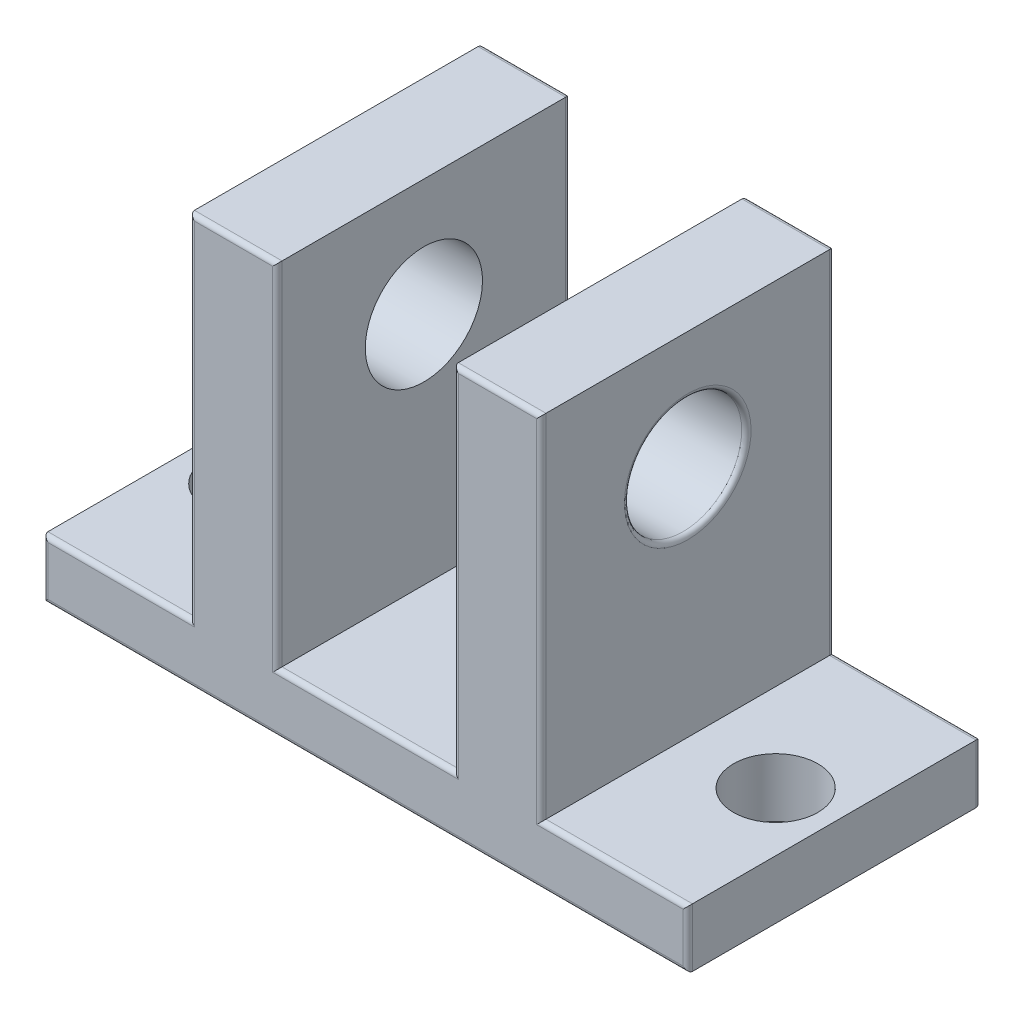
ISO-10303-21;
HEADER;
FILE_DESCRIPTION(('STEP AP214'),'2;1');
FILE_NAME('part.step','',(''),(''),'','','');
FILE_SCHEMA(('AUTOMOTIVE_DESIGN { 1 0 10303 214 1 1 1 1 }'));
ENDSEC;
DATA;
#1=APPLICATION_CONTEXT('core data for automotive mechanical design processes');
#2=APPLICATION_PROTOCOL_DEFINITION('international standard','automotive_design',2000,#1);
#3=PRODUCT_CONTEXT('',#1,'mechanical');
#4=PRODUCT('Part','Part','',(#3));
#5=PRODUCT_RELATED_PRODUCT_CATEGORY('part','',(#4));
#6=PRODUCT_DEFINITION_FORMATION('','',#4);
#7=PRODUCT_DEFINITION_CONTEXT('part definition',#1,'design');
#8=PRODUCT_DEFINITION('design','',#6,#7);
#9=PRODUCT_DEFINITION_SHAPE('','',#8);
#10=(LENGTH_UNIT() NAMED_UNIT(*) SI_UNIT(.MILLI.,.METRE.));
#11=(NAMED_UNIT(*) PLANE_ANGLE_UNIT() SI_UNIT($,.RADIAN.));
#12=(NAMED_UNIT(*) SI_UNIT($,.STERADIAN.) SOLID_ANGLE_UNIT());
#13=UNCERTAINTY_MEASURE_WITH_UNIT(LENGTH_MEASURE(1.E-05),#10,'distance_accuracy_value','');
#14=(GEOMETRIC_REPRESENTATION_CONTEXT(3) GLOBAL_UNCERTAINTY_ASSIGNED_CONTEXT((#13)) GLOBAL_UNIT_ASSIGNED_CONTEXT((#10,
#11,#12)) REPRESENTATION_CONTEXT('',''));
#15=CARTESIAN_POINT('',(0.,0.,0.));
#16=DIRECTION('',(0.,0.,1.));
#17=DIRECTION('',(1.,0.,0.));
#18=AXIS2_PLACEMENT_3D('',#15,#16,#17);
#19=CARTESIAN_POINT('',(-17.4625000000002,-8.65973959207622E-12,15.8749999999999));
#20=DIRECTION('',(0.,1.,0.));
#21=DIRECTION('',(0.,0.,0.999999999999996));
#22=AXIS2_PLACEMENT_3D('',#19,#20,#21);
#23=PLANE('',#22);
#24=CARTESIAN_POINT('',(-14.2875000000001,-1.33226762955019E-12,7.93749999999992));
#25=DIRECTION('',(0.,1.,0.));
#26=DIRECTION('',(0.,0.,0.999999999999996));
#27=AXIS2_PLACEMENT_3D('',#24,#25,#26);
#28=CIRCLE('',#27,2.286);
#29=CARTESIAN_POINT('',(-14.2875000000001,-1.33178382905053E-12,10.2234999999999));
#30=VERTEX_POINT('',#29);
#31=EDGE_CURVE('E543',#30,#30,#28,.T.);
#32=ORIENTED_EDGE('',*,*,#31,.T.);
#33=EDGE_LOOP('',(#32));
#34=FACE_BOUND('',#33,.T.);
#35=DIRECTION('',(0.,0.,-0.999999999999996));
#36=VECTOR('',#35,1.);
#37=CARTESIAN_POINT('',(17.4624999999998,-7.32747196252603E-12,15.875));
#38=LINE('',#37,#36);
#39=CARTESIAN_POINT('',(17.4625,-8.43769498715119E-12,15.6210000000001));
#40=VERTEX_POINT('',#39);
#41=CARTESIAN_POINT('',(17.4624999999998,0.,0.25399999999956));
#42=VERTEX_POINT('',#41);
#43=EDGE_CURVE('E582',#40,#42,#38,.T.);
#44=ORIENTED_EDGE('',*,*,#43,.F.);
#45=DIRECTION('',(0.999999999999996,0.,0.));
#46=VECTOR('',#45,1.);
#47=CARTESIAN_POINT('',(-17.4625000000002,-7.99360577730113E-12,15.6210000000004));
#48=LINE('',#47,#46);
#49=CARTESIAN_POINT('',(-17.4625000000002,-7.99360577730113E-12,15.6210000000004));
#50=VERTEX_POINT('',#49);
#51=EDGE_CURVE('E273',#40,#50,#48,.F.);
#52=ORIENTED_EDGE('',*,*,#51,.T.);
#53=DIRECTION('',(0.,0.,-0.999999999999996));
#54=VECTOR('',#53,1.);
#55=CARTESIAN_POINT('',(-17.4625000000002,-8.65973959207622E-12,15.8749999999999));
#56=LINE('',#55,#54);
#57=CARTESIAN_POINT('',(-17.4625,0.,0.253999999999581));
#58=VERTEX_POINT('',#57);
#59=EDGE_CURVE('E214',#50,#58,#56,.T.);
#60=ORIENTED_EDGE('',*,*,#59,.T.);
#61=DIRECTION('',(0.999999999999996,0.,0.));
#62=VECTOR('',#61,1.);
#63=CARTESIAN_POINT('',(-17.4625,0.,0.253999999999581));
#64=LINE('',#63,#62);
#65=EDGE_CURVE('E270',#58,#42,#64,.T.);
#66=ORIENTED_EDGE('',*,*,#65,.T.);
#67=EDGE_LOOP('',(#44,#52,#60,#66));
#68=FACE_BOUND('',#67,.T.);
#69=CARTESIAN_POINT('',(14.2874999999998,-7.32747196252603E-12,7.93749999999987));
#70=DIRECTION('',(0.,1.,0.));
#71=DIRECTION('',(0.,0.,0.999999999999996));
#72=AXIS2_PLACEMENT_3D('',#69,#70,#71);
#73=CIRCLE('',#72,2.286);
#74=CARTESIAN_POINT('',(14.2874999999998,-7.32698816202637E-12,10.2234999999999));
#75=VERTEX_POINT('',#74);
#76=EDGE_CURVE('E539',#75,#75,#73,.T.);
#77=ORIENTED_EDGE('',*,*,#76,.T.);
#78=EDGE_LOOP('',(#77));
#79=FACE_BOUND('',#78,.T.);
#80=ADVANCED_FACE('F32',(#34,#68,#79),#23,.F.);
#81=CARTESIAN_POINT('',(17.4624999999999,3.17499999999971,15.8750000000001));
#82=DIRECTION('',(0.,-1.,0.));
#83=DIRECTION('',(0.999999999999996,0.,0.));
#84=AXIS2_PLACEMENT_3D('',#81,#82,#83);
#85=PLANE('',#84);
#86=DIRECTION('',(0.,0.,-0.999999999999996));
#87=VECTOR('',#86,1.);
#88=CARTESIAN_POINT('',(9.52499999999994,3.17499999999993,15.8749999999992));
#89=LINE('',#88,#87);
#90=CARTESIAN_POINT('',(9.52499999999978,3.17499999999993,15.6209999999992));
#91=VERTEX_POINT('',#90);
#92=CARTESIAN_POINT('',(9.52499999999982,3.17499999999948,0.254000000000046));
#93=VERTEX_POINT('',#92);
#94=EDGE_CURVE('E576',#91,#93,#89,.T.);
#95=ORIENTED_EDGE('',*,*,#94,.F.);
#96=DIRECTION('',(-0.999999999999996,0.,0.));
#97=VECTOR('',#96,1.);
#98=CARTESIAN_POINT('',(-17.4625000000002,3.17499999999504,15.6209999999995));
#99=LINE('',#98,#97);
#100=CARTESIAN_POINT('',(17.4625,3.17499999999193,15.6209999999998));
#101=VERTEX_POINT('',#100);
#102=EDGE_CURVE('E264',#91,#101,#99,.F.);
#103=ORIENTED_EDGE('',*,*,#102,.T.);
#104=DIRECTION('',(0.,0.,-0.999999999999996));
#105=VECTOR('',#104,1.);
#106=CARTESIAN_POINT('',(17.4624999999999,3.17499999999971,15.8750000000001));
#107=LINE('',#106,#105);
#108=CARTESIAN_POINT('',(17.4624999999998,3.17499999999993,0.253999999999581));
#109=VERTEX_POINT('',#108);
#110=EDGE_CURVE('E579',#101,#109,#107,.T.);
#111=ORIENTED_EDGE('',*,*,#110,.T.);
#112=DIRECTION('',(-0.999999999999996,0.,0.));
#113=VECTOR('',#112,1.);
#114=CARTESIAN_POINT('',(17.4624999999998,3.17499999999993,0.253999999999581));
#115=LINE('',#114,#113);
#116=EDGE_CURVE('E262',#109,#93,#115,.T.);
#117=ORIENTED_EDGE('',*,*,#116,.T.);
#118=EDGE_LOOP('',(#95,#103,#111,#117));
#119=FACE_BOUND('',#118,.T.);
#120=CARTESIAN_POINT('',(14.2874999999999,3.17499999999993,7.93749999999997));
#121=DIRECTION('',(0.,-1.,0.));
#122=DIRECTION('',(0.999999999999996,0.,0.));
#123=AXIS2_PLACEMENT_3D('',#120,#121,#122);
#124=CIRCLE('',#123,2.286);
#125=CARTESIAN_POINT('',(16.5734999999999,3.17499999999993,7.93749999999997));
#126=VERTEX_POINT('',#125);
#127=EDGE_CURVE('E542',#126,#126,#124,.F.);
#128=ORIENTED_EDGE('',*,*,#127,.F.);
#129=EDGE_LOOP('',(#128));
#130=FACE_BOUND('',#129,.T.);
#131=ADVANCED_FACE('F323',(#119,#130),#85,.F.);
#132=CARTESIAN_POINT('',(-9.52500000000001,3.17500000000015,15.8750000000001));
#133=DIRECTION('',(0.,-1.,0.));
#134=DIRECTION('',(0.999999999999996,0.,0.));
#135=AXIS2_PLACEMENT_3D('',#132,#133,#134);
#136=PLANE('',#135);
#137=DIRECTION('',(0.,0.,-0.999999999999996));
#138=VECTOR('',#137,1.);
#139=CARTESIAN_POINT('',(-17.4625000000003,3.17499999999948,15.875));
#140=LINE('',#139,#138);
#141=CARTESIAN_POINT('',(-17.4625000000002,3.17499999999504,15.6209999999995));
#142=VERTEX_POINT('',#141);
#143=CARTESIAN_POINT('',(-17.4624999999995,3.17499999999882,0.253999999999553));
#144=VERTEX_POINT('',#143);
#145=EDGE_CURVE('E552',#142,#144,#140,.T.);
#146=ORIENTED_EDGE('',*,*,#145,.F.);
#147=DIRECTION('',(-0.999999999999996,0.,0.));
#148=VECTOR('',#147,1.);
#149=CARTESIAN_POINT('',(-17.4625000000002,3.17499999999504,15.6209999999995));
#150=LINE('',#149,#148);
#151=CARTESIAN_POINT('',(-9.52499999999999,3.17499999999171,15.6209999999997));
#152=VERTEX_POINT('',#151);
#153=EDGE_CURVE('E200',#142,#152,#150,.F.);
#154=ORIENTED_EDGE('',*,*,#153,.T.);
#155=DIRECTION('',(0.,0.,-0.999999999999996));
#156=VECTOR('',#155,1.);
#157=CARTESIAN_POINT('',(-9.52500000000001,3.17500000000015,15.8750000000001));
#158=LINE('',#157,#156);
#159=CARTESIAN_POINT('',(-9.52500000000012,3.17499999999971,0.253999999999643));
#160=VERTEX_POINT('',#159);
#161=EDGE_CURVE('E555',#152,#160,#158,.T.);
#162=ORIENTED_EDGE('',*,*,#161,.T.);
#163=DIRECTION('',(-0.999999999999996,0.,0.));
#164=VECTOR('',#163,1.);
#165=CARTESIAN_POINT('',(-9.52500000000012,3.17499999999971,0.253999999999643));
#166=LINE('',#165,#164);
#167=EDGE_CURVE('E220',#160,#144,#166,.T.);
#168=ORIENTED_EDGE('',*,*,#167,.T.);
#169=EDGE_LOOP('',(#146,#154,#162,#168));
#170=FACE_BOUND('',#169,.T.);
#171=CARTESIAN_POINT('',(-14.2875000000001,3.17499999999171,7.9374999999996));
#172=DIRECTION('',(0.,-1.,0.));
#173=DIRECTION('',(0.999999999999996,0.,0.));
#174=AXIS2_PLACEMENT_3D('',#171,#172,#173);
#175=CIRCLE('',#174,2.286);
#176=CARTESIAN_POINT('',(-12.0015000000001,3.17499999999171,7.93749999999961));
#177=VERTEX_POINT('',#176);
#178=EDGE_CURVE('E545',#177,#177,#175,.F.);
#179=ORIENTED_EDGE('',*,*,#178,.F.);
#180=EDGE_LOOP('',(#179));
#181=FACE_BOUND('',#180,.T.);
#182=ADVANCED_FACE('F328',(#170,#181),#136,.F.);
#183=CARTESIAN_POINT('',(-17.4625000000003,3.17499999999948,15.875));
#184=DIRECTION('',(0.999999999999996,0.,0.));
#185=DIRECTION('',(0.,0.,-0.999999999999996));
#186=AXIS2_PLACEMENT_3D('',#183,#184,#185);
#187=PLANE('',#186);
#188=ORIENTED_EDGE('',*,*,#59,.F.);
#189=DIRECTION('',(0.,-1.,0.));
#190=VECTOR('',#189,1.);
#191=CARTESIAN_POINT('',(-17.4625000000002,-7.99360577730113E-12,15.6210000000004));
#192=LINE('',#191,#190);
#193=EDGE_CURVE('E277',#50,#142,#192,.F.);
#194=ORIENTED_EDGE('',*,*,#193,.T.);
#195=ORIENTED_EDGE('',*,*,#145,.T.);
#196=DIRECTION('',(0.,-1.,0.));
#197=VECTOR('',#196,1.);
#198=CARTESIAN_POINT('',(-17.4624999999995,3.17499999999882,0.253999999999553));
#199=LINE('',#198,#197);
#200=EDGE_CURVE('E275',#144,#58,#199,.T.);
#201=ORIENTED_EDGE('',*,*,#200,.T.);
#202=EDGE_LOOP('',(#188,#194,#195,#201));
#203=FACE_BOUND('',#202,.T.);
#204=ADVANCED_FACE('F34',(#203),#187,.F.);
#205=CARTESIAN_POINT('',(17.4624999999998,-7.32747196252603E-12,15.875));
#206=DIRECTION('',(-0.999999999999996,0.,0.));
#207=DIRECTION('',(0.,0.,0.999999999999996));
#208=AXIS2_PLACEMENT_3D('',#205,#206,#207);
#209=PLANE('',#208);
#210=ORIENTED_EDGE('',*,*,#110,.F.);
#211=DIRECTION('',(0.,1.,0.));
#212=VECTOR('',#211,1.);
#213=CARTESIAN_POINT('',(17.4625,-8.43769498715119E-12,15.6210000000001));
#214=LINE('',#213,#212);
#215=EDGE_CURVE('E268',#101,#40,#214,.F.);
#216=ORIENTED_EDGE('',*,*,#215,.T.);
#217=ORIENTED_EDGE('',*,*,#43,.T.);
#218=DIRECTION('',(0.,1.,0.));
#219=VECTOR('',#218,1.);
#220=CARTESIAN_POINT('',(17.4624999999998,0.,0.25399999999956));
#221=LINE('',#220,#219);
#222=EDGE_CURVE('E266',#42,#109,#221,.T.);
#223=ORIENTED_EDGE('',*,*,#222,.T.);
#224=EDGE_LOOP('',(#210,#216,#217,#223));
#225=FACE_BOUND('',#224,.T.);
#226=ADVANCED_FACE('F334',(#225),#209,.F.);
#227=CARTESIAN_POINT('',(9.52499999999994,3.17499999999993,15.8749999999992));
#228=DIRECTION('',(-0.999999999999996,0.,0.));
#229=DIRECTION('',(0.,-1.,0.));
#230=AXIS2_PLACEMENT_3D('',#227,#228,#229);
#231=PLANE('',#230);
#232=CARTESIAN_POINT('',(9.52499999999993,15.8749999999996,7.93749999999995));
#233=DIRECTION('',(-0.999999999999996,0.,0.));
#234=DIRECTION('',(0.,-1.,0.));
#235=AXIS2_PLACEMENT_3D('',#232,#233,#234);
#236=CIRCLE('',#235,3.429);
#237=CARTESIAN_POINT('',(9.52499999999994,12.4459999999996,7.93749999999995));
#238=VERTEX_POINT('',#237);
#239=EDGE_CURVE('E255',#238,#238,#236,.T.);
#240=ORIENTED_EDGE('',*,*,#239,.T.);
#241=EDGE_LOOP('',(#240));
#242=FACE_BOUND('',#241,.T.);
#243=DIRECTION('',(0.,0.,-0.999999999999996));
#244=VECTOR('',#243,1.);
#245=CARTESIAN_POINT('',(9.5249999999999,22.2250000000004,15.875));
#246=LINE('',#245,#244);
#247=CARTESIAN_POINT('',(9.52499999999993,22.225000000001,15.6209999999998));
#248=VERTEX_POINT('',#247);
#249=CARTESIAN_POINT('',(9.52499999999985,22.2249999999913,0.253999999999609));
#250=VERTEX_POINT('',#249);
#251=EDGE_CURVE('E573',#248,#250,#246,.T.);
#252=ORIENTED_EDGE('',*,*,#251,.F.);
#253=DIRECTION('',(0.,1.,0.));
#254=VECTOR('',#253,1.);
#255=CARTESIAN_POINT('',(9.52499999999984,-5.99520433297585E-12,15.6209999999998));
#256=LINE('',#255,#254);
#257=EDGE_CURVE('E260',#248,#91,#256,.F.);
#258=ORIENTED_EDGE('',*,*,#257,.T.);
#259=ORIENTED_EDGE('',*,*,#94,.T.);
#260=DIRECTION('',(0.,1.,0.));
#261=VECTOR('',#260,1.);
#262=CARTESIAN_POINT('',(9.52499999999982,3.17499999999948,0.254000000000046));
#263=LINE('',#262,#261);
#264=EDGE_CURVE('E258',#93,#250,#263,.T.);
#265=ORIENTED_EDGE('',*,*,#264,.T.);
#266=EDGE_LOOP('',(#252,#258,#259,#265));
#267=FACE_BOUND('',#266,.T.);
#268=ADVANCED_FACE('F336',(#242,#267),#231,.F.);
#269=CARTESIAN_POINT('',(9.5249999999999,22.2250000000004,15.875));
#270=DIRECTION('',(0.,-1.,0.));
#271=DIRECTION('',(0.,0.,-0.999999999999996));
#272=AXIS2_PLACEMENT_3D('',#269,#270,#271);
#273=PLANE('',#272);
#274=DIRECTION('',(0.,0.,-0.999999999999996));
#275=VECTOR('',#274,1.);
#276=CARTESIAN_POINT('',(4.77519999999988,22.2249999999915,15.8749999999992));
#277=LINE('',#276,#275);
#278=CARTESIAN_POINT('',(4.77519999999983,22.2249999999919,15.620999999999));
#279=VERTEX_POINT('',#278);
#280=CARTESIAN_POINT('',(4.77519999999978,22.2249999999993,0.253999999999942));
#281=VERTEX_POINT('',#280);
#282=EDGE_CURVE('E570',#279,#281,#277,.T.);
#283=ORIENTED_EDGE('',*,*,#282,.F.);
#284=DIRECTION('',(-0.999999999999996,0.,0.));
#285=VECTOR('',#284,1.);
#286=CARTESIAN_POINT('',(-17.4625000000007,22.2249999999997,15.6209999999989));
#287=LINE('',#286,#285);
#288=EDGE_CURVE('E253',#279,#248,#287,.F.);
#289=ORIENTED_EDGE('',*,*,#288,.T.);
#290=ORIENTED_EDGE('',*,*,#251,.T.);
#291=DIRECTION('',(-0.999999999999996,0.,0.));
#292=VECTOR('',#291,1.);
#293=CARTESIAN_POINT('',(9.52499999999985,22.2249999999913,0.253999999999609));
#294=LINE('',#293,#292);
#295=EDGE_CURVE('E251',#250,#281,#294,.T.);
#296=ORIENTED_EDGE('',*,*,#295,.T.);
#297=EDGE_LOOP('',(#283,#289,#290,#296));
#298=FACE_BOUND('',#297,.T.);
#299=ADVANCED_FACE('F341',(#298),#273,.F.);
#300=CARTESIAN_POINT('',(4.77519999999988,22.2249999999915,15.8749999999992));
#301=DIRECTION('',(0.999999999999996,0.,0.));
#302=DIRECTION('',(0.,1.,0.));
#303=AXIS2_PLACEMENT_3D('',#300,#301,#302);
#304=PLANE('',#303);
#305=CARTESIAN_POINT('',(4.77519999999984,15.8749999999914,7.93749999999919));
#306=DIRECTION('',(0.999999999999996,0.,0.));
#307=DIRECTION('',(0.,1.,0.));
#308=AXIS2_PLACEMENT_3D('',#305,#306,#307);
#309=CIRCLE('',#308,3.175);
#310=CARTESIAN_POINT('',(4.77519999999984,19.049999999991,7.93749999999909));
#311=VERTEX_POINT('',#310);
#312=EDGE_CURVE('E549',#311,#311,#309,.T.);
#313=ORIENTED_EDGE('',*,*,#312,.T.);
#314=EDGE_LOOP('',(#313));
#315=FACE_BOUND('',#314,.T.);
#316=DIRECTION('',(0.,0.,-0.999999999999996));
#317=VECTOR('',#316,1.);
#318=CARTESIAN_POINT('',(4.7751999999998,3.17499999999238,15.8750000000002));
#319=LINE('',#318,#317);
#320=CARTESIAN_POINT('',(4.7751999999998,3.17499999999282,15.6209999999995));
#321=VERTEX_POINT('',#320);
#322=CARTESIAN_POINT('',(4.77519999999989,3.17499999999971,0.25399999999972));
#323=VERTEX_POINT('',#322);
#324=EDGE_CURVE('E567',#321,#323,#319,.T.);
#325=ORIENTED_EDGE('',*,*,#324,.F.);
#326=DIRECTION('',(0.,-1.,0.));
#327=VECTOR('',#326,1.);
#328=CARTESIAN_POINT('',(4.77519999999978,4.44089209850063E-13,15.6210000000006));
#329=LINE('',#328,#327);
#330=EDGE_CURVE('E249',#321,#279,#329,.F.);
#331=ORIENTED_EDGE('',*,*,#330,.T.);
#332=ORIENTED_EDGE('',*,*,#282,.T.);
#333=DIRECTION('',(0.,-1.,0.));
#334=VECTOR('',#333,1.);
#335=CARTESIAN_POINT('',(4.77519999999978,22.2249999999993,0.253999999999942));
#336=LINE('',#335,#334);
#337=EDGE_CURVE('E247',#281,#323,#336,.T.);
#338=ORIENTED_EDGE('',*,*,#337,.T.);
#339=EDGE_LOOP('',(#325,#331,#332,#338));
#340=FACE_BOUND('',#339,.T.);
#341=ADVANCED_FACE('F345',(#315,#340),#304,.F.);
#342=CARTESIAN_POINT('',(4.7751999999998,3.17499999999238,15.8750000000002));
#343=DIRECTION('',(0.,-1.,0.));
#344=DIRECTION('',(0.999999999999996,0.,0.));
#345=AXIS2_PLACEMENT_3D('',#342,#343,#344);
#346=PLANE('',#345);
#347=DIRECTION('',(0.,0.,-0.999999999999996));
#348=VECTOR('',#347,1.);
#349=CARTESIAN_POINT('',(-4.77520000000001,3.17499999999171,15.8749999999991));
#350=LINE('',#349,#348);
#351=CARTESIAN_POINT('',(-4.77519999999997,3.17500000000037,15.620999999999));
#352=VERTEX_POINT('',#351);
#353=CARTESIAN_POINT('',(-4.77520000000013,3.17499999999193,0.253999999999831));
#354=VERTEX_POINT('',#353);
#355=EDGE_CURVE('E564',#352,#354,#350,.T.);
#356=ORIENTED_EDGE('',*,*,#355,.F.);
#357=DIRECTION('',(-0.999999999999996,0.,0.));
#358=VECTOR('',#357,1.);
#359=CARTESIAN_POINT('',(-17.4625000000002,3.17499999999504,15.6209999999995));
#360=LINE('',#359,#358);
#361=EDGE_CURVE('E245',#352,#321,#360,.F.);
#362=ORIENTED_EDGE('',*,*,#361,.T.);
#363=ORIENTED_EDGE('',*,*,#324,.T.);
#364=DIRECTION('',(-0.999999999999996,0.,0.));
#365=VECTOR('',#364,1.);
#366=CARTESIAN_POINT('',(4.77519999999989,3.17499999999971,0.25399999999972));
#367=LINE('',#366,#365);
#368=EDGE_CURVE('E243',#323,#354,#367,.T.);
#369=ORIENTED_EDGE('',*,*,#368,.T.);
#370=EDGE_LOOP('',(#356,#362,#363,#369));
#371=FACE_BOUND('',#370,.T.);
#372=ADVANCED_FACE('F349',(#371),#346,.F.);
#373=CARTESIAN_POINT('',(-4.77520000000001,3.17499999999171,15.8749999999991));
#374=DIRECTION('',(-0.999999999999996,0.,0.));
#375=DIRECTION('',(0.,0.,0.999999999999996));
#376=AXIS2_PLACEMENT_3D('',#373,#374,#375);
#377=PLANE('',#376);
#378=CARTESIAN_POINT('',(-4.77520000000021,15.8749999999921,7.93749999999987));
#379=DIRECTION('',(-0.999999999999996,0.,0.));
#380=DIRECTION('',(0.,0.,0.999999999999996));
#381=AXIS2_PLACEMENT_3D('',#378,#379,#380);
#382=CIRCLE('',#381,3.175);
#383=CARTESIAN_POINT('',(-4.77520000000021,19.049999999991,7.93749999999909));
#384=VERTEX_POINT('',#383);
#385=EDGE_CURVE('E546',#384,#384,#382,.T.);
#386=ORIENTED_EDGE('',*,*,#385,.T.);
#387=EDGE_LOOP('',(#386));
#388=FACE_BOUND('',#387,.T.);
#389=DIRECTION('',(0.,0.,-0.999999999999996));
#390=VECTOR('',#389,1.);
#391=CARTESIAN_POINT('',(-4.77520000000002,22.2250000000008,15.875));
#392=LINE('',#391,#390);
#393=CARTESIAN_POINT('',(-4.77519999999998,22.2250000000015,15.6209999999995));
#394=VERTEX_POINT('',#393);
#395=CARTESIAN_POINT('',(-4.7752000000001,22.2249999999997,0.253999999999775));
#396=VERTEX_POINT('',#395);
#397=EDGE_CURVE('E561',#394,#396,#392,.T.);
#398=ORIENTED_EDGE('',*,*,#397,.F.);
#399=DIRECTION('',(0.,1.,0.));
#400=VECTOR('',#399,1.);
#401=CARTESIAN_POINT('',(-4.77519999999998,-8.88178419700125E-12,15.6209999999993));
#402=LINE('',#401,#400);
#403=EDGE_CURVE('E241',#394,#352,#402,.F.);
#404=ORIENTED_EDGE('',*,*,#403,.T.);
#405=ORIENTED_EDGE('',*,*,#355,.T.);
#406=DIRECTION('',(0.,1.,0.));
#407=VECTOR('',#406,1.);
#408=CARTESIAN_POINT('',(-4.77520000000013,3.17499999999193,0.253999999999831));
#409=LINE('',#408,#407);
#410=EDGE_CURVE('E239',#354,#396,#409,.T.);
#411=ORIENTED_EDGE('',*,*,#410,.T.);
#412=EDGE_LOOP('',(#398,#404,#405,#411));
#413=FACE_BOUND('',#412,.T.);
#414=ADVANCED_FACE('F353',(#388,#413),#377,.F.);
#415=CARTESIAN_POINT('',(-4.77520000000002,22.2250000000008,15.875));
#416=DIRECTION('',(0.,-1.,0.));
#417=DIRECTION('',(0.,0.,-0.999999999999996));
#418=AXIS2_PLACEMENT_3D('',#415,#416,#417);
#419=PLANE('',#418);
#420=DIRECTION('',(0.,0.,-0.999999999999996));
#421=VECTOR('',#420,1.);
#422=CARTESIAN_POINT('',(-9.52499999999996,22.2249999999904,15.8749999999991));
#423=LINE('',#422,#421);
#424=CARTESIAN_POINT('',(-9.52499999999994,22.2249999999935,15.620999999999));
#425=VERTEX_POINT('',#424);
#426=CARTESIAN_POINT('',(-9.5250000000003,22.2249999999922,0.253999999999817));
#427=VERTEX_POINT('',#426);
#428=EDGE_CURVE('E558',#425,#427,#423,.T.);
#429=ORIENTED_EDGE('',*,*,#428,.F.);
#430=DIRECTION('',(-0.999999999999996,0.,0.));
#431=VECTOR('',#430,1.);
#432=CARTESIAN_POINT('',(-17.4625000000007,22.2249999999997,15.6209999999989));
#433=LINE('',#432,#431);
#434=EDGE_CURVE('E237',#425,#394,#433,.F.);
#435=ORIENTED_EDGE('',*,*,#434,.T.);
#436=ORIENTED_EDGE('',*,*,#397,.T.);
#437=DIRECTION('',(-0.999999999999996,0.,0.));
#438=VECTOR('',#437,1.);
#439=CARTESIAN_POINT('',(-4.7752000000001,22.2249999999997,0.253999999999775));
#440=LINE('',#439,#438);
#441=EDGE_CURVE('E235',#396,#427,#440,.T.);
#442=ORIENTED_EDGE('',*,*,#441,.T.);
#443=EDGE_LOOP('',(#429,#435,#436,#442));
#444=FACE_BOUND('',#443,.T.);
#445=ADVANCED_FACE('F357',(#444),#419,.F.);
#446=CARTESIAN_POINT('',(-9.52499999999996,22.2249999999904,15.8749999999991));
#447=DIRECTION('',(0.999999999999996,0.,0.));
#448=DIRECTION('',(0.,1.,0.));
#449=AXIS2_PLACEMENT_3D('',#446,#447,#448);
#450=PLANE('',#449);
#451=CARTESIAN_POINT('',(-9.52500000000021,15.8749999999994,7.93749999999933));
#452=DIRECTION('',(0.999999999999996,0.,0.));
#453=DIRECTION('',(0.,1.,0.));
#454=AXIS2_PLACEMENT_3D('',#451,#452,#453);
#455=CIRCLE('',#454,3.429);
#456=CARTESIAN_POINT('',(-9.52500000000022,19.3039999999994,7.93749999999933));
#457=VERTEX_POINT('',#456);
#458=EDGE_CURVE('E228',#457,#457,#455,.T.);
#459=ORIENTED_EDGE('',*,*,#458,.T.);
#460=EDGE_LOOP('',(#459));
#461=FACE_BOUND('',#460,.T.);
#462=ORIENTED_EDGE('',*,*,#161,.F.);
#463=DIRECTION('',(0.,-1.,0.));
#464=VECTOR('',#463,1.);
#465=CARTESIAN_POINT('',(-9.52500000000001,-8.43769498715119E-12,15.6210000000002));
#466=LINE('',#465,#464);
#467=EDGE_CURVE('E233',#152,#425,#466,.F.);
#468=ORIENTED_EDGE('',*,*,#467,.T.);
#469=ORIENTED_EDGE('',*,*,#428,.T.);
#470=DIRECTION('',(0.,-1.,0.));
#471=VECTOR('',#470,1.);
#472=CARTESIAN_POINT('',(-9.5250000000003,22.2249999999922,0.253999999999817));
#473=LINE('',#472,#471);
#474=EDGE_CURVE('E231',#427,#160,#473,.T.);
#475=ORIENTED_EDGE('',*,*,#474,.T.);
#476=EDGE_LOOP('',(#462,#468,#469,#475));
#477=FACE_BOUND('',#476,.T.);
#478=ADVANCED_FACE('F361',(#461,#477),#450,.F.);
#479=CARTESIAN_POINT('',(-17.4625000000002,-8.65973959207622E-12,15.8749999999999));
#480=DIRECTION('',(0.,0.,0.999999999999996));
#481=DIRECTION('',(0.999999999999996,0.,0.));
#482=AXIS2_PLACEMENT_3D('',#479,#480,#481);
#483=PLANE('',#482);
#484=DIRECTION('',(0.,-1.,0.));
#485=VECTOR('',#484,1.);
#486=CARTESIAN_POINT('',(-9.27099999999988,-7.7715611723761E-12,15.8749999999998));
#487=LINE('',#486,#485);
#488=CARTESIAN_POINT('',(-9.27100000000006,21.9710000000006,15.8749999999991));
#489=VERTEX_POINT('',#488);
#490=CARTESIAN_POINT('',(-9.27099999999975,2.92099999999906,15.875));
#491=VERTEX_POINT('',#490);
#492=EDGE_CURVE('E218',#489,#491,#487,.T.);
#493=ORIENTED_EDGE('',*,*,#492,.T.);
#494=DIRECTION('',(-0.999999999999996,0.,0.));
#495=VECTOR('',#494,1.);
#496=CARTESIAN_POINT('',(-17.4625000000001,2.92099999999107,15.8749999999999));
#497=LINE('',#496,#495);
#498=CARTESIAN_POINT('',(-17.2085000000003,2.92100000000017,15.875));
#499=VERTEX_POINT('',#498);
#500=EDGE_CURVE('E198',#491,#499,#497,.T.);
#501=ORIENTED_EDGE('',*,*,#500,.T.);
#502=DIRECTION('',(0.,-1.,0.));
#503=VECTOR('',#502,1.);
#504=CARTESIAN_POINT('',(-17.2085000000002,-8.21565038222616E-12,15.8749999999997));
#505=LINE('',#504,#503);
#506=CARTESIAN_POINT('',(-17.2085000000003,0.253999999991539,15.8749999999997));
#507=VERTEX_POINT('',#506);
#508=EDGE_CURVE('E207',#499,#507,#505,.T.);
#509=ORIENTED_EDGE('',*,*,#508,.T.);
#510=DIRECTION('',(0.999999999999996,0.,0.));
#511=VECTOR('',#510,1.);
#512=CARTESIAN_POINT('',(-17.4625000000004,0.253999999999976,15.875));
#513=LINE('',#512,#511);
#514=CARTESIAN_POINT('',(17.2084999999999,0.253999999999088,15.8750000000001));
#515=VERTEX_POINT('',#514);
#516=EDGE_CURVE('E213',#507,#515,#513,.T.);
#517=ORIENTED_EDGE('',*,*,#516,.T.);
#518=DIRECTION('',(0.,1.,0.));
#519=VECTOR('',#518,1.);
#520=CARTESIAN_POINT('',(17.2084999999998,-7.105427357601E-12,15.8749999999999));
#521=LINE('',#520,#519);
#522=CARTESIAN_POINT('',(17.2084999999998,2.92099999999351,15.8749999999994));
#523=VERTEX_POINT('',#522);
#524=EDGE_CURVE('E592',#515,#523,#521,.T.);
#525=ORIENTED_EDGE('',*,*,#524,.T.);
#526=DIRECTION('',(-0.999999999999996,0.,0.));
#527=VECTOR('',#526,1.);
#528=CARTESIAN_POINT('',(-17.4625000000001,2.92099999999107,15.8749999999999));
#529=LINE('',#528,#527);
#530=CARTESIAN_POINT('',(9.27099999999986,2.92099999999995,15.8749999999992));
#531=VERTEX_POINT('',#530);
#532=EDGE_CURVE('E594',#523,#531,#529,.T.);
#533=ORIENTED_EDGE('',*,*,#532,.T.);
#534=DIRECTION('',(0.,1.,0.));
#535=VECTOR('',#534,1.);
#536=CARTESIAN_POINT('',(9.27099999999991,-7.99360577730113E-12,15.8749999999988));
#537=LINE('',#536,#535);
#538=CARTESIAN_POINT('',(9.27099999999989,21.9710000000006,15.875));
#539=VERTEX_POINT('',#538);
#540=EDGE_CURVE('E596',#531,#539,#537,.T.);
#541=ORIENTED_EDGE('',*,*,#540,.T.);
#542=DIRECTION('',(-0.999999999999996,0.,0.));
#543=VECTOR('',#542,1.);
#544=CARTESIAN_POINT('',(-17.4625000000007,21.9710000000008,15.875));
#545=LINE('',#544,#543);
#546=CARTESIAN_POINT('',(5.02919999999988,21.9710000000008,15.8749999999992));
#547=VERTEX_POINT('',#546);
#548=EDGE_CURVE('E598',#539,#547,#545,.T.);
#549=ORIENTED_EDGE('',*,*,#548,.T.);
#550=DIRECTION('',(0.,-1.,0.));
#551=VECTOR('',#550,1.);
#552=CARTESIAN_POINT('',(5.02919999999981,-7.105427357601E-12,15.8749999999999));
#553=LINE('',#552,#551);
#554=CARTESIAN_POINT('',(5.02919999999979,2.92100000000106,15.875));
#555=VERTEX_POINT('',#554);
#556=EDGE_CURVE('E600',#547,#555,#553,.T.);
#557=ORIENTED_EDGE('',*,*,#556,.T.);
#558=DIRECTION('',(-0.999999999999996,0.,0.));
#559=VECTOR('',#558,1.);
#560=CARTESIAN_POINT('',(-17.4625000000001,2.92099999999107,15.8749999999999));
#561=LINE('',#560,#559);
#562=CARTESIAN_POINT('',(-5.02919999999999,2.92100000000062,15.8749999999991));
#563=VERTEX_POINT('',#562);
#564=EDGE_CURVE('E602',#555,#563,#561,.T.);
#565=ORIENTED_EDGE('',*,*,#564,.T.);
#566=DIRECTION('',(0.,1.,0.));
#567=VECTOR('',#566,1.);
#568=CARTESIAN_POINT('',(-5.02919999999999,-4.44089209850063E-13,15.8749999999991));
#569=LINE('',#568,#567);
#570=CARTESIAN_POINT('',(-5.02919999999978,21.9709999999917,15.8750000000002));
#571=VERTEX_POINT('',#570);
#572=EDGE_CURVE('E604',#563,#571,#569,.T.);
#573=ORIENTED_EDGE('',*,*,#572,.T.);
#574=DIRECTION('',(-0.999999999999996,0.,0.));
#575=VECTOR('',#574,1.);
#576=CARTESIAN_POINT('',(-17.4625000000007,21.9710000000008,15.875));
#577=LINE('',#576,#575);
#578=EDGE_CURVE('E223',#571,#489,#577,.T.);
#579=ORIENTED_EDGE('',*,*,#578,.T.);
#580=EDGE_LOOP('',(#493,#501,#509,#517,#525,#533,#541,#549,#557,#565,#573,#579));
#581=FACE_BOUND('',#580,.T.);
#582=ADVANCED_FACE('F216',(#581),#483,.T.);
#583=CARTESIAN_POINT('',(-17.4625000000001,-7.99360577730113E-12,-5.06539254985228E-13));
#584=DIRECTION('',(0.,0.,0.999999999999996));
#585=DIRECTION('',(0.999999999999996,0.,0.));
#586=AXIS2_PLACEMENT_3D('',#583,#584,#585);
#587=PLANE('',#586);
#588=DIRECTION('',(0.,1.,0.));
#589=VECTOR('',#588,1.);
#590=CARTESIAN_POINT('',(17.2084999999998,-8.88178419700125E-12,-4.92661467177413E-13));
#591=LINE('',#590,#589);
#592=CARTESIAN_POINT('',(17.2084999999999,2.92099999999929,-4.44089209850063E-13));
#593=VERTEX_POINT('',#592);
#594=CARTESIAN_POINT('',(17.2084999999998,0.253999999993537,-3.81639164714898E-13));
#595=VERTEX_POINT('',#594);
#596=EDGE_CURVE('E47',#593,#595,#591,.F.);
#597=ORIENTED_EDGE('',*,*,#596,.T.);
#598=DIRECTION('',(0.999999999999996,0.,0.));
#599=VECTOR('',#598,1.);
#600=CARTESIAN_POINT('',(-17.4625,0.253999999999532,-3.81639164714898E-13));
#601=LINE('',#600,#599);
#602=CARTESIAN_POINT('',(-17.2085000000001,0.253999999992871,-1.31838984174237E-13));
#603=VERTEX_POINT('',#602);
#604=EDGE_CURVE('E299',#595,#603,#601,.F.);
#605=ORIENTED_EDGE('',*,*,#604,.T.);
#606=DIRECTION('',(0.,-1.,0.));
#607=VECTOR('',#606,1.);
#608=CARTESIAN_POINT('',(-17.2085000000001,6.66133814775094E-13,-2.63677968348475E-13));
#609=LINE('',#608,#607);
#610=CARTESIAN_POINT('',(-17.2085000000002,2.9209999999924,-3.60822483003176E-13));
#611=VERTEX_POINT('',#610);
#612=EDGE_CURVE('E279',#603,#611,#609,.F.);
#613=ORIENTED_EDGE('',*,*,#612,.T.);
#614=DIRECTION('',(-0.999999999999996,0.,0.));
#615=VECTOR('',#614,1.);
#616=CARTESIAN_POINT('',(-17.4625,2.92099999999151,-1.52655665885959E-13));
#617=LINE('',#616,#615);
#618=CARTESIAN_POINT('',(-9.27099999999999,2.92099999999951,3.12250225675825E-13));
#619=VERTEX_POINT('',#618);
#620=EDGE_CURVE('E281',#611,#619,#617,.F.);
#621=ORIENTED_EDGE('',*,*,#620,.T.);
#622=DIRECTION('',(0.,-1.,0.));
#623=VECTOR('',#622,1.);
#624=CARTESIAN_POINT('',(-9.27099999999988,-8.43769498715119E-12,-1.59594559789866E-13));
#625=LINE('',#624,#623);
#626=CARTESIAN_POINT('',(-9.27099999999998,21.9709999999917,-2.28983498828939E-13));
#627=VERTEX_POINT('',#626);
#628=EDGE_CURVE('E283',#619,#627,#625,.F.);
#629=ORIENTED_EDGE('',*,*,#628,.T.);
#630=DIRECTION('',(-0.999999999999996,0.,0.));
#631=VECTOR('',#630,1.);
#632=CARTESIAN_POINT('',(-17.4625,21.9709999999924,-1.31838984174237E-13));
#633=LINE('',#632,#631);
#634=CARTESIAN_POINT('',(-5.02919999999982,21.9709999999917,-4.23272528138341E-13));
#635=VERTEX_POINT('',#634);
#636=EDGE_CURVE('E285',#627,#635,#633,.F.);
#637=ORIENTED_EDGE('',*,*,#636,.T.);
#638=DIRECTION('',(0.,1.,0.));
#639=VECTOR('',#638,1.);
#640=CARTESIAN_POINT('',(-5.0292,-8.88178419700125E-12,-4.09394740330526E-13));
#641=LINE('',#640,#639);
#642=CARTESIAN_POINT('',(-5.0292,2.92099999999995,2.08166817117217E-13));
#643=VERTEX_POINT('',#642);
#644=EDGE_CURVE('E287',#635,#643,#641,.F.);
#645=ORIENTED_EDGE('',*,*,#644,.T.);
#646=DIRECTION('',(-0.999999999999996,0.,0.));
#647=VECTOR('',#646,1.);
#648=CARTESIAN_POINT('',(-17.4625,2.92099999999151,-1.52655665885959E-13));
#649=LINE('',#648,#647);
#650=CARTESIAN_POINT('',(5.02919999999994,2.92099999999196,2.08166817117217E-13));
#651=VERTEX_POINT('',#650);
#652=EDGE_CURVE('E289',#643,#651,#649,.F.);
#653=ORIENTED_EDGE('',*,*,#652,.T.);
#654=DIRECTION('',(0.,-1.,0.));
#655=VECTOR('',#654,1.);
#656=CARTESIAN_POINT('',(5.02919999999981,4.44089209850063E-13,1.66533453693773E-13));
#657=LINE('',#656,#655);
#658=CARTESIAN_POINT('',(5.02919999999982,21.9709999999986,0.));
#659=VERTEX_POINT('',#658);
#660=EDGE_CURVE('E291',#651,#659,#657,.F.);
#661=ORIENTED_EDGE('',*,*,#660,.T.);
#662=DIRECTION('',(-0.999999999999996,0.,0.));
#663=VECTOR('',#662,1.);
#664=CARTESIAN_POINT('',(-17.4625,21.9709999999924,-1.31838984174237E-13));
#665=LINE('',#664,#663);
#666=CARTESIAN_POINT('',(9.27099999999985,21.971,-4.23272528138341E-13));
#667=VERTEX_POINT('',#666);
#668=EDGE_CURVE('E293',#659,#667,#665,.F.);
#669=ORIENTED_EDGE('',*,*,#668,.T.);
#670=DIRECTION('',(0.,1.,0.));
#671=VECTOR('',#670,1.);
#672=CARTESIAN_POINT('',(9.27099999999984,-8.65973959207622E-12,-4.9960036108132E-13));
#673=LINE('',#672,#671);
#674=CARTESIAN_POINT('',(9.27099999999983,2.92099999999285,2.56739074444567E-13));
#675=VERTEX_POINT('',#674);
#676=EDGE_CURVE('E295',#667,#675,#673,.F.);
#677=ORIENTED_EDGE('',*,*,#676,.T.);
#678=DIRECTION('',(-0.999999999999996,0.,0.));
#679=VECTOR('',#678,1.);
#680=CARTESIAN_POINT('',(-17.4625,2.92099999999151,-1.52655665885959E-13));
#681=LINE('',#680,#679);
#682=EDGE_CURVE('E52',#675,#593,#681,.F.);
#683=ORIENTED_EDGE('',*,*,#682,.T.);
#684=EDGE_LOOP('',(#597,#605,#613,#621,#629,#637,#645,#653,#661,#669,#677,#683));
#685=FACE_BOUND('',#684,.T.);
#686=ADVANCED_FACE('F371',(#685),#587,.F.);
#687=CARTESIAN_POINT('',(-17.4625000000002,15.874999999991,7.93749999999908));
#688=DIRECTION('',(0.999999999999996,0.,0.));
#689=DIRECTION('',(0.,1.,0.));
#690=AXIS2_PLACEMENT_3D('',#687,#688,#689);
#691=CYLINDRICAL_SURFACE('',#690,3.175);
#692=CARTESIAN_POINT('',(-9.27100000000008,15.8749999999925,7.93749999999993));
#693=DIRECTION('',(0.999999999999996,0.,0.));
#694=DIRECTION('',(0.,1.,0.));
#695=AXIS2_PLACEMENT_3D('',#692,#693,#694);
#696=CIRCLE('',#695,3.175);
#697=CARTESIAN_POINT('',(-9.27100000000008,19.049999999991,7.93749999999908));
#698=VERTEX_POINT('',#697);
#699=EDGE_CURVE('E11',#698,#698,#696,.F.);
#700=CARTESIAN_POINT('',(-9.27100000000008,19.049999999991,7.93749999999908));
#701=CARTESIAN_POINT('',(-9.22416875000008,19.049999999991,7.93749999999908));
#702=CARTESIAN_POINT('',(-9.17733750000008,19.049999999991,7.93749999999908));
#703=CARTESIAN_POINT('',(-9.08367500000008,19.049999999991,7.93749999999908));
#704=CARTESIAN_POINT('',(-9.03684375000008,19.049999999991,7.93749999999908));
#705=CARTESIAN_POINT('',(-8.94318125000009,19.049999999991,7.93749999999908));
#706=CARTESIAN_POINT('',(-8.89635000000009,19.049999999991,7.93749999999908));
#707=CARTESIAN_POINT('',(-8.80268750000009,19.049999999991,7.93749999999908));
#708=CARTESIAN_POINT('',(-8.75585625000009,19.049999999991,7.93749999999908));
#709=CARTESIAN_POINT('',(-8.66219375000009,19.049999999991,7.93749999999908));
#710=CARTESIAN_POINT('',(-8.61536250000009,19.049999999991,7.93749999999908));
#711=CARTESIAN_POINT('',(-8.5217000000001,19.049999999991,7.93749999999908));
#712=CARTESIAN_POINT('',(-8.4748687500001,19.049999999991,7.93749999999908));
#713=CARTESIAN_POINT('',(-8.3812062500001,19.049999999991,7.93749999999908));
#714=CARTESIAN_POINT('',(-8.3343750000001,19.049999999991,7.93749999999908));
#715=CARTESIAN_POINT('',(-8.2407125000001,19.049999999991,7.93749999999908));
#716=CARTESIAN_POINT('',(-8.19388125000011,19.049999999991,7.93749999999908));
#717=CARTESIAN_POINT('',(-8.10021875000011,19.049999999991,7.93749999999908));
#718=CARTESIAN_POINT('',(-8.05338750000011,19.049999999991,7.93749999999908));
#719=CARTESIAN_POINT('',(-7.95972500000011,19.049999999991,7.93749999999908));
#720=CARTESIAN_POINT('',(-7.91289375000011,19.049999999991,7.93749999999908));
#721=CARTESIAN_POINT('',(-7.81923125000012,19.049999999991,7.93749999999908));
#722=CARTESIAN_POINT('',(-7.77240000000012,19.049999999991,7.93749999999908));
#723=CARTESIAN_POINT('',(-7.67873750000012,19.049999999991,7.93749999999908));
#724=CARTESIAN_POINT('',(-7.63190625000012,19.049999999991,7.93749999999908));
#725=CARTESIAN_POINT('',(-7.53824375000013,19.049999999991,7.93749999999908));
#726=CARTESIAN_POINT('',(-7.49141250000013,19.049999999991,7.93749999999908));
#727=CARTESIAN_POINT('',(-7.39775000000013,19.049999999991,7.93749999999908));
#728=CARTESIAN_POINT('',(-7.35091875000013,19.049999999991,7.93749999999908));
#729=CARTESIAN_POINT('',(-7.25725625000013,19.049999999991,7.93749999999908));
#730=CARTESIAN_POINT('',(-7.21042500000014,19.049999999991,7.93749999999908));
#731=CARTESIAN_POINT('',(-7.11676250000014,19.049999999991,7.93749999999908));
#732=CARTESIAN_POINT('',(-7.06993125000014,19.049999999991,7.93749999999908));
#733=CARTESIAN_POINT('',(-6.97626875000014,19.049999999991,7.93749999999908));
#734=CARTESIAN_POINT('',(-6.92943750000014,19.049999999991,7.93749999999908));
#735=CARTESIAN_POINT('',(-6.83577500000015,19.049999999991,7.93749999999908));
#736=CARTESIAN_POINT('',(-6.78894375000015,19.049999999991,7.93749999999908));
#737=CARTESIAN_POINT('',(-6.69528125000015,19.049999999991,7.93749999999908));
#738=CARTESIAN_POINT('',(-6.64845000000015,19.049999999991,7.93749999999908));
#739=CARTESIAN_POINT('',(-6.55478750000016,19.049999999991,7.93749999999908));
#740=CARTESIAN_POINT('',(-6.50795625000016,19.049999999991,7.93749999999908));
#741=CARTESIAN_POINT('',(-6.41429375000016,19.049999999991,7.93749999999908));
#742=CARTESIAN_POINT('',(-6.36746250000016,19.049999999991,7.93749999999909));
#743=CARTESIAN_POINT('',(-6.27380000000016,19.049999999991,7.93749999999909));
#744=CARTESIAN_POINT('',(-6.22696875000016,19.049999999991,7.93749999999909));
#745=CARTESIAN_POINT('',(-6.13330625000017,19.049999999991,7.93749999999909));
#746=CARTESIAN_POINT('',(-6.08647500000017,19.049999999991,7.93749999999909));
#747=CARTESIAN_POINT('',(-5.99281250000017,19.049999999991,7.93749999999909));
#748=CARTESIAN_POINT('',(-5.94598125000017,19.049999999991,7.93749999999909));
#749=CARTESIAN_POINT('',(-5.85231875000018,19.049999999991,7.93749999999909));
#750=CARTESIAN_POINT('',(-5.80548750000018,19.049999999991,7.93749999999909));
#751=CARTESIAN_POINT('',(-5.71182500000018,19.049999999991,7.93749999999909));
#752=CARTESIAN_POINT('',(-5.66499375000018,19.049999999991,7.93749999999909));
#753=CARTESIAN_POINT('',(-5.57133125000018,19.049999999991,7.93749999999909));
#754=CARTESIAN_POINT('',(-5.52450000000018,19.049999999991,7.93749999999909));
#755=CARTESIAN_POINT('',(-5.43083750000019,19.049999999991,7.93749999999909));
#756=CARTESIAN_POINT('',(-5.38400625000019,19.049999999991,7.93749999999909));
#757=CARTESIAN_POINT('',(-5.29034375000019,19.049999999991,7.93749999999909));
#758=CARTESIAN_POINT('',(-5.24351250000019,19.049999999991,7.93749999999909));
#759=CARTESIAN_POINT('',(-5.1498500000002,19.049999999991,7.93749999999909));
#760=CARTESIAN_POINT('',(-5.1030187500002,19.049999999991,7.93749999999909));
#761=CARTESIAN_POINT('',(-5.0093562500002,19.049999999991,7.93749999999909));
#762=CARTESIAN_POINT('',(-4.9625250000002,19.049999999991,7.93749999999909));
#763=CARTESIAN_POINT('',(-4.8688625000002,19.049999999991,7.93749999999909));
#764=CARTESIAN_POINT('',(-4.82203125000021,19.049999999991,7.93749999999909));
#765=CARTESIAN_POINT('',(-4.77520000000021,19.049999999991,7.93749999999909));
#766=B_SPLINE_CURVE_WITH_KNOTS('',3,(#700,#701,#702,#703,#704,#705,#706,#707,#708,#709,#710,
#711,#712,#713,#714,#715,#716,#717,#718,#719,#720,#721,#722,#723,#724,#725,#726,#727,#728,#729,
#730,#731,#732,#733,#734,#735,#736,#737,#738,#739,#740,#741,#742,#743,#744,#745,#746,#747,#748,
#749,#750,#751,#752,#753,#754,#755,#756,#757,#758,#759,#760,#761,#762,#763,#764,#765),
.UNSPECIFIED.,.F.,.F.,(4,2,2,2,2,2,2,2,2,2,2,2,2,2,2,2,2,2,2,2,2,2,2,2,2,2,2,2,2,2,2,2,4),(0.,
0.140493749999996,0.280987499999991,0.421481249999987,0.561974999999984,0.70246874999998,
0.842962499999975,0.983456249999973,1.12394999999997,1.26444374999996,1.40493749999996,
1.54543124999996,1.68592499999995,1.82641874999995,1.96691249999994,2.10740624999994,
2.24789999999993,2.38839374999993,2.52888749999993,2.66938124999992,2.80987499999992,
2.95036874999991,3.09086249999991,3.23135624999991,3.3718499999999,3.5123437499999,
3.65283749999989,3.79333124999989,3.93382499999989,4.07431874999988,4.21481249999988,
4.35530624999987,4.49579999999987),.UNSPECIFIED.);
#767=EDGE_CURVE('BSEAM374',#698,#384,#766,.T.);
#768=ORIENTED_EDGE('',*,*,#699,.T.);
#769=ORIENTED_EDGE('',*,*,#385,.F.);
#770=ORIENTED_EDGE('',*,*,#767,.T.);
#771=ORIENTED_EDGE('',*,*,#767,.F.);
#772=EDGE_LOOP('',(#768,#770,#769,#771));
#773=FACE_BOUND('',#772,.T.);
#774=ADVANCED_FACE('F374',(#773),#691,.F.);
#775=CARTESIAN_POINT('',(9.27099999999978,15.8749999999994,7.93749999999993));
#776=DIRECTION('',(-0.999999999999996,0.,0.));
#777=DIRECTION('',(0.,-1.,0.));
#778=AXIS2_PLACEMENT_3D('',#775,#776,#777);
#779=CIRCLE('',#778,3.175);
#780=CARTESIAN_POINT('',(9.27099999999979,19.049999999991,7.9374999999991));
#781=VERTEX_POINT('',#780);
#782=EDGE_CURVE('E40',#781,#781,#779,.F.);
#783=CARTESIAN_POINT('',(9.27099999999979,19.049999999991,7.9374999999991));
#784=CARTESIAN_POINT('',(9.22416874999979,19.049999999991,7.9374999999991));
#785=CARTESIAN_POINT('',(9.17733749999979,19.049999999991,7.9374999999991));
#786=CARTESIAN_POINT('',(9.08367499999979,19.049999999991,7.9374999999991));
#787=CARTESIAN_POINT('',(9.03684374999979,19.049999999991,7.9374999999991));
#788=CARTESIAN_POINT('',(8.94318124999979,19.049999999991,7.9374999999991));
#789=CARTESIAN_POINT('',(8.89634999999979,19.049999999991,7.9374999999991));
#790=CARTESIAN_POINT('',(8.80268749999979,19.049999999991,7.9374999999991));
#791=CARTESIAN_POINT('',(8.75585624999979,19.049999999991,7.9374999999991));
#792=CARTESIAN_POINT('',(8.6621937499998,19.049999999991,7.9374999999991));
#793=CARTESIAN_POINT('',(8.6153624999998,19.049999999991,7.9374999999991));
#794=CARTESIAN_POINT('',(8.52169999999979,19.049999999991,7.9374999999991));
#795=CARTESIAN_POINT('',(8.47486874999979,19.049999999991,7.93749999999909));
#796=CARTESIAN_POINT('',(8.3812062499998,19.049999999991,7.93749999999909));
#797=CARTESIAN_POINT('',(8.3343749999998,19.049999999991,7.93749999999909));
#798=CARTESIAN_POINT('',(8.2407124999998,19.049999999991,7.93749999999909));
#799=CARTESIAN_POINT('',(8.1938812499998,19.049999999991,7.93749999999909));
#800=CARTESIAN_POINT('',(8.1002187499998,19.049999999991,7.93749999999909));
#801=CARTESIAN_POINT('',(8.0533874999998,19.049999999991,7.93749999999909));
#802=CARTESIAN_POINT('',(7.95972499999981,19.049999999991,7.93749999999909));
#803=CARTESIAN_POINT('',(7.9128937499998,19.049999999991,7.93749999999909));
#804=CARTESIAN_POINT('',(7.81923124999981,19.049999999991,7.93749999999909));
#805=CARTESIAN_POINT('',(7.7723999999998,19.049999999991,7.93749999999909));
#806=CARTESIAN_POINT('',(7.6787374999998,19.049999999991,7.93749999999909));
#807=CARTESIAN_POINT('',(7.63190624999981,19.049999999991,7.93749999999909));
#808=CARTESIAN_POINT('',(7.53824374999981,19.049999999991,7.93749999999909));
#809=CARTESIAN_POINT('',(7.49141249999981,19.049999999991,7.93749999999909));
#810=CARTESIAN_POINT('',(7.39774999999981,19.049999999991,7.93749999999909));
#811=CARTESIAN_POINT('',(7.35091874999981,19.049999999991,7.93749999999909));
#812=CARTESIAN_POINT('',(7.25725624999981,19.049999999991,7.93749999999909));
#813=CARTESIAN_POINT('',(7.21042499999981,19.049999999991,7.93749999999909));
#814=CARTESIAN_POINT('',(7.11676249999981,19.049999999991,7.93749999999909));
#815=CARTESIAN_POINT('',(7.06993124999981,19.049999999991,7.93749999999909));
#816=CARTESIAN_POINT('',(6.97626874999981,19.049999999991,7.93749999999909));
#817=CARTESIAN_POINT('',(6.92943749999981,19.049999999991,7.93749999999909));
#818=CARTESIAN_POINT('',(6.83577499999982,19.049999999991,7.93749999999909));
#819=CARTESIAN_POINT('',(6.78894374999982,19.049999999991,7.93749999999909));
#820=CARTESIAN_POINT('',(6.69528124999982,19.049999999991,7.93749999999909));
#821=CARTESIAN_POINT('',(6.64844999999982,19.049999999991,7.93749999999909));
#822=CARTESIAN_POINT('',(6.55478749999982,19.049999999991,7.93749999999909));
#823=CARTESIAN_POINT('',(6.50795624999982,19.049999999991,7.93749999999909));
#824=CARTESIAN_POINT('',(6.41429374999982,19.049999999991,7.93749999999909));
#825=CARTESIAN_POINT('',(6.36746249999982,19.049999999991,7.93749999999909));
#826=CARTESIAN_POINT('',(6.27379999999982,19.049999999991,7.93749999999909));
#827=CARTESIAN_POINT('',(6.22696874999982,19.049999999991,7.93749999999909));
#828=CARTESIAN_POINT('',(6.13330624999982,19.049999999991,7.93749999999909));
#829=CARTESIAN_POINT('',(6.08647499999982,19.049999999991,7.93749999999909));
#830=CARTESIAN_POINT('',(5.99281249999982,19.049999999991,7.93749999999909));
#831=CARTESIAN_POINT('',(5.94598124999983,19.049999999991,7.93749999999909));
#832=CARTESIAN_POINT('',(5.85231874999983,19.049999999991,7.93749999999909));
#833=CARTESIAN_POINT('',(5.80548749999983,19.049999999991,7.93749999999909));
#834=CARTESIAN_POINT('',(5.71182499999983,19.049999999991,7.93749999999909));
#835=CARTESIAN_POINT('',(5.66499374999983,19.049999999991,7.93749999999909));
#836=CARTESIAN_POINT('',(5.57133124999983,19.049999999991,7.93749999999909));
#837=CARTESIAN_POINT('',(5.52449999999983,19.049999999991,7.93749999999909));
#838=CARTESIAN_POINT('',(5.43083749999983,19.049999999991,7.93749999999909));
#839=CARTESIAN_POINT('',(5.38400624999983,19.049999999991,7.93749999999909));
#840=CARTESIAN_POINT('',(5.29034374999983,19.049999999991,7.93749999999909));
#841=CARTESIAN_POINT('',(5.24351249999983,19.049999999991,7.93749999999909));
#842=CARTESIAN_POINT('',(5.14984999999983,19.049999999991,7.93749999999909));
#843=CARTESIAN_POINT('',(5.10301874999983,19.049999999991,7.93749999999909));
#844=CARTESIAN_POINT('',(5.00935624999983,19.049999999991,7.93749999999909));
#845=CARTESIAN_POINT('',(4.96252499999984,19.049999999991,7.93749999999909));
#846=CARTESIAN_POINT('',(4.86886249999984,19.049999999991,7.93749999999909));
#847=CARTESIAN_POINT('',(4.82203124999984,19.049999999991,7.93749999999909));
#848=CARTESIAN_POINT('',(4.77519999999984,19.049999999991,7.93749999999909));
#849=B_SPLINE_CURVE_WITH_KNOTS('',3,(#783,#784,#785,#786,#787,#788,#789,#790,#791,#792,#793,
#794,#795,#796,#797,#798,#799,#800,#801,#802,#803,#804,#805,#806,#807,#808,#809,#810,#811,#812,
#813,#814,#815,#816,#817,#818,#819,#820,#821,#822,#823,#824,#825,#826,#827,#828,#829,#830,#831,
#832,#833,#834,#835,#836,#837,#838,#839,#840,#841,#842,#843,#844,#845,#846,#847,#848),
.UNSPECIFIED.,.F.,.F.,(4,2,2,2,2,2,2,2,2,2,2,2,2,2,2,2,2,2,2,2,2,2,2,2,2,2,2,2,2,2,2,2,4),(0.,
0.140493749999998,0.280987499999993,0.421481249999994,0.561974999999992,0.70246874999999,
0.842962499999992,0.98345624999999,1.12394999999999,1.26444374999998,1.40493749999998,
1.54543124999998,1.68592499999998,1.82641874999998,1.96691249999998,2.10740624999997,
2.24789999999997,2.38839374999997,2.52888749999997,2.66938124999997,2.80987499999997,
2.95036874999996,3.09086249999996,3.23135624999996,3.37184999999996,3.51234374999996,
3.65283749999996,3.79333124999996,3.93382499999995,4.07431874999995,4.21481249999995,
4.35530624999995,4.49579999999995),.UNSPECIFIED.);
#850=EDGE_CURVE('BSEAM303',#781,#311,#849,.T.);
#851=ORIENTED_EDGE('',*,*,#782,.T.);
#852=ORIENTED_EDGE('',*,*,#312,.F.);
#853=ORIENTED_EDGE('',*,*,#850,.T.);
#854=ORIENTED_EDGE('',*,*,#850,.F.);
#855=EDGE_LOOP('',(#851,#853,#852,#854));
#856=FACE_BOUND('',#855,.T.);
#857=ADVANCED_FACE('F303',(#856),#691,.F.);
#858=CARTESIAN_POINT('',(-14.2874999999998,22.2250000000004,7.93749999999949));
#859=DIRECTION('',(0.,-1.,0.));
#860=DIRECTION('',(0.,0.,-0.999999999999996));
#861=AXIS2_PLACEMENT_3D('',#858,#859,#860);
#862=CYLINDRICAL_SURFACE('',#861,2.286);
#863=ORIENTED_EDGE('',*,*,#31,.F.);
#864=EDGE_LOOP('',(#863));
#865=FACE_BOUND('',#864,.T.);
#866=ORIENTED_EDGE('',*,*,#178,.T.);
#867=EDGE_LOOP('',(#866));
#868=FACE_BOUND('',#867,.T.);
#869=ADVANCED_FACE('F377',(#865,#868),#862,.F.);
#870=CARTESIAN_POINT('',(14.2874999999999,22.2249999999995,7.93749999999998));
#871=DIRECTION('',(0.,-1.,0.));
#872=DIRECTION('',(0.,0.,-0.999999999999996));
#873=AXIS2_PLACEMENT_3D('',#870,#871,#872);
#874=CYLINDRICAL_SURFACE('',#873,2.286);
#875=ORIENTED_EDGE('',*,*,#76,.F.);
#876=EDGE_LOOP('',(#875));
#877=FACE_BOUND('',#876,.T.);
#878=ORIENTED_EDGE('',*,*,#127,.T.);
#879=EDGE_LOOP('',(#878));
#880=FACE_BOUND('',#879,.T.);
#881=ADVANCED_FACE('F380',(#877,#880),#874,.F.);
#882=CARTESIAN_POINT('',(-17.4625000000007,21.9710000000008,15.6209999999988));
#883=DIRECTION('',(0.999999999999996,0.,0.));
#884=DIRECTION('',(0.,0.,-0.999999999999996));
#885=AXIS2_PLACEMENT_3D('',#882,#883,#884);
#886=CYLINDRICAL_SURFACE('',#885,0.254);
#887=CARTESIAN_POINT('',(9.27099999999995,21.9709999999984,15.6210000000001));
#888=DIRECTION('',(0.707106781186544,-0.707106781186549,0.));
#889=DIRECTION('',(-0.707106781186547,-0.707106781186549,0.));
#890=AXIS2_PLACEMENT_3D('',#887,#888,#889);
#891=ELLIPSE('',#890,0.359210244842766,0.254);
#892=EDGE_CURVE('E533',#248,#539,#891,.T.);
#893=ORIENTED_EDGE('',*,*,#892,.F.);
#894=ORIENTED_EDGE('',*,*,#288,.F.);
#895=CARTESIAN_POINT('',(5.02919999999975,21.9710000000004,15.6209999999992));
#896=DIRECTION('',(0.707106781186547,0.707106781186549,0.));
#897=DIRECTION('',(0.707106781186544,-0.707106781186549,0.));
#898=AXIS2_PLACEMENT_3D('',#895,#896,#897);
#899=ELLIPSE('',#898,0.359210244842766,0.254);
#900=EDGE_CURVE('E536',#547,#279,#899,.F.);
#901=ORIENTED_EDGE('',*,*,#900,.F.);
#902=ORIENTED_EDGE('',*,*,#548,.F.);
#903=EDGE_LOOP('',(#893,#894,#901,#902));
#904=FACE_BOUND('',#903,.T.);
#905=ADVANCED_FACE('F384',(#904),#886,.T.);
#906=CARTESIAN_POINT('',(5.02919999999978,-8.43769498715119E-12,15.6210000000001));
#907=DIRECTION('',(0.,1.,0.));
#908=DIRECTION('',(-0.999999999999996,0.,0.));
#909=AXIS2_PLACEMENT_3D('',#906,#907,#908);
#910=CYLINDRICAL_SURFACE('',#909,0.254);
#911=ORIENTED_EDGE('',*,*,#900,.T.);
#912=ORIENTED_EDGE('',*,*,#330,.F.);
#913=CARTESIAN_POINT('',(5.02919999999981,2.92099999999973,15.6209999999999));
#914=DIRECTION('',(0.707106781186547,0.707106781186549,0.));
#915=DIRECTION('',(0.707106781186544,-0.707106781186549,0.));
#916=AXIS2_PLACEMENT_3D('',#913,#914,#915);
#917=ELLIPSE('',#916,0.359210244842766,0.254);
#918=EDGE_CURVE('E530',#555,#321,#917,.F.);
#919=ORIENTED_EDGE('',*,*,#918,.F.);
#920=ORIENTED_EDGE('',*,*,#556,.F.);
#921=EDGE_LOOP('',(#911,#912,#919,#920));
#922=FACE_BOUND('',#921,.T.);
#923=ADVANCED_FACE('F388',(#922),#910,.T.);
#924=CARTESIAN_POINT('',(9.2709999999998,-8.43769498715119E-12,15.620999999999));
#925=DIRECTION('',(0.,-1.,0.));
#926=DIRECTION('',(0.999999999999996,0.,0.));
#927=AXIS2_PLACEMENT_3D('',#924,#925,#926);
#928=CYLINDRICAL_SURFACE('',#927,0.254);
#929=ORIENTED_EDGE('',*,*,#892,.T.);
#930=ORIENTED_EDGE('',*,*,#540,.F.);
#931=CARTESIAN_POINT('',(9.27099999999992,2.92100000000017,15.6209999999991));
#932=DIRECTION('',(0.707106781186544,-0.707106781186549,0.));
#933=DIRECTION('',(-0.707106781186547,-0.707106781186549,0.));
#934=AXIS2_PLACEMENT_3D('',#931,#932,#933);
#935=ELLIPSE('',#934,0.359210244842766,0.254);
#936=EDGE_CURVE('E527',#91,#531,#935,.T.);
#937=ORIENTED_EDGE('',*,*,#936,.F.);
#938=ORIENTED_EDGE('',*,*,#257,.F.);
#939=EDGE_LOOP('',(#929,#930,#937,#938));
#940=FACE_BOUND('',#939,.T.);
#941=ADVANCED_FACE('F392',(#940),#928,.T.);
#942=CARTESIAN_POINT('',(-17.4625000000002,2.92099999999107,15.6209999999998));
#943=DIRECTION('',(0.999999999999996,0.,0.));
#944=DIRECTION('',(0.,1.,0.));
#945=AXIS2_PLACEMENT_3D('',#942,#943,#944);
#946=CYLINDRICAL_SURFACE('',#945,0.254);
#947=ORIENTED_EDGE('',*,*,#918,.T.);
#948=ORIENTED_EDGE('',*,*,#361,.F.);
#949=CARTESIAN_POINT('',(-5.02919999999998,2.92099999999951,15.6209999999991));
#950=DIRECTION('',(0.707106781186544,-0.707106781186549,0.));
#951=DIRECTION('',(-0.707106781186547,-0.707106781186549,0.));
#952=AXIS2_PLACEMENT_3D('',#949,#950,#951);
#953=ELLIPSE('',#952,0.359210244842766,0.254);
#954=EDGE_CURVE('E524',#563,#352,#953,.F.);
#955=ORIENTED_EDGE('',*,*,#954,.F.);
#956=ORIENTED_EDGE('',*,*,#564,.F.);
#957=EDGE_LOOP('',(#947,#948,#955,#956));
#958=FACE_BOUND('',#957,.T.);
#959=ADVANCED_FACE('F396',(#958),#946,.T.);
#960=CARTESIAN_POINT('',(-17.4625000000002,2.92099999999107,15.6209999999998));
#961=DIRECTION('',(0.999999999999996,0.,0.));
#962=DIRECTION('',(0.,1.,0.));
#963=AXIS2_PLACEMENT_3D('',#960,#961,#962);
#964=CYLINDRICAL_SURFACE('',#963,0.254);
#965=ORIENTED_EDGE('',*,*,#936,.T.);
#966=ORIENTED_EDGE('',*,*,#532,.F.);
#967=CARTESIAN_POINT('',(17.2085,2.92099999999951,15.6209999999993));
#968=DIRECTION('',(0.707106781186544,-0.707106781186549,0.));
#969=DIRECTION('',(-0.707106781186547,-0.707106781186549,0.));
#970=AXIS2_PLACEMENT_3D('',#967,#968,#969);
#971=ELLIPSE('',#970,0.359210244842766,0.254);
#972=EDGE_CURVE('E521',#101,#523,#971,.T.);
#973=ORIENTED_EDGE('',*,*,#972,.F.);
#974=ORIENTED_EDGE('',*,*,#102,.F.);
#975=EDGE_LOOP('',(#965,#966,#973,#974));
#976=FACE_BOUND('',#975,.T.);
#977=ADVANCED_FACE('F400',(#976),#964,.T.);
#978=CARTESIAN_POINT('',(-5.02919999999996,-4.44089209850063E-13,15.6209999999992));
#979=DIRECTION('',(0.,-1.,0.));
#980=DIRECTION('',(0.,0.,-0.999999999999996));
#981=AXIS2_PLACEMENT_3D('',#978,#979,#980);
#982=CYLINDRICAL_SURFACE('',#981,0.254);
#983=ORIENTED_EDGE('',*,*,#954,.T.);
#984=ORIENTED_EDGE('',*,*,#403,.F.);
#985=CARTESIAN_POINT('',(-5.0292000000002,21.9709999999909,15.6210000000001));
#986=DIRECTION('',(0.707106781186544,-0.707106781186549,0.));
#987=DIRECTION('',(-0.707106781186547,-0.707106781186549,0.));
#988=AXIS2_PLACEMENT_3D('',#985,#986,#987);
#989=ELLIPSE('',#988,0.359210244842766,0.254);
#990=EDGE_CURVE('E518',#571,#394,#989,.F.);
#991=ORIENTED_EDGE('',*,*,#990,.F.);
#992=ORIENTED_EDGE('',*,*,#572,.F.);
#993=EDGE_LOOP('',(#983,#984,#991,#992));
#994=FACE_BOUND('',#993,.T.);
#995=ADVANCED_FACE('F404',(#994),#982,.T.);
#996=CARTESIAN_POINT('',(17.2085,-4.44089209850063E-13,15.6210000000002));
#997=DIRECTION('',(0.,-1.,0.));
#998=DIRECTION('',(0.,0.,-0.999999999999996));
#999=AXIS2_PLACEMENT_3D('',#996,#997,#998);
#1000=CYLINDRICAL_SURFACE('',#999,0.254);
#1001=ORIENTED_EDGE('',*,*,#972,.T.);
#1002=ORIENTED_EDGE('',*,*,#524,.F.);
#1003=CARTESIAN_POINT('',(17.2085,0.253999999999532,15.6209999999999));
#1004=DIRECTION('',(-0.707106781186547,-0.707106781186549,0.));
#1005=DIRECTION('',(-0.707106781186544,0.707106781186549,0.));
#1006=AXIS2_PLACEMENT_3D('',#1003,#1004,#1005);
#1007=ELLIPSE('',#1006,0.359210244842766,0.254);
#1008=EDGE_CURVE('E515',#40,#515,#1007,.T.);
#1009=ORIENTED_EDGE('',*,*,#1008,.F.);
#1010=ORIENTED_EDGE('',*,*,#215,.F.);
#1011=EDGE_LOOP('',(#1001,#1002,#1009,#1010));
#1012=FACE_BOUND('',#1011,.T.);
#1013=ADVANCED_FACE('F408',(#1012),#1000,.T.);
#1014=CARTESIAN_POINT('',(-17.4625000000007,21.9710000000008,15.6209999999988));
#1015=DIRECTION('',(0.999999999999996,0.,0.));
#1016=DIRECTION('',(0.,0.,-0.999999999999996));
#1017=AXIS2_PLACEMENT_3D('',#1014,#1015,#1016);
#1018=CYLINDRICAL_SURFACE('',#1017,0.254);
#1019=ORIENTED_EDGE('',*,*,#990,.T.);
#1020=ORIENTED_EDGE('',*,*,#434,.F.);
#1021=CARTESIAN_POINT('',(-9.27100000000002,21.9709999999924,15.6209999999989));
#1022=DIRECTION('',(0.707106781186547,0.707106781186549,0.));
#1023=DIRECTION('',(0.707106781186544,-0.707106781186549,0.));
#1024=AXIS2_PLACEMENT_3D('',#1021,#1022,#1023);
#1025=ELLIPSE('',#1024,0.359210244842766,0.254);
#1026=EDGE_CURVE('E512',#489,#425,#1025,.F.);
#1027=ORIENTED_EDGE('',*,*,#1026,.F.);
#1028=ORIENTED_EDGE('',*,*,#578,.F.);
#1029=EDGE_LOOP('',(#1019,#1020,#1027,#1028));
#1030=FACE_BOUND('',#1029,.T.);
#1031=ADVANCED_FACE('F412',(#1030),#1018,.T.);
#1032=CARTESIAN_POINT('',(-17.4625000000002,0.253999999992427,15.6210000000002));
#1033=DIRECTION('',(-0.999999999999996,0.,0.));
#1034=DIRECTION('',(0.,0.,0.999999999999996));
#1035=AXIS2_PLACEMENT_3D('',#1032,#1033,#1034);
#1036=CYLINDRICAL_SURFACE('',#1035,0.254);
#1037=ORIENTED_EDGE('',*,*,#1008,.T.);
#1038=ORIENTED_EDGE('',*,*,#516,.F.);
#1039=CARTESIAN_POINT('',(-17.2085000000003,0.253999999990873,15.6209999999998));
#1040=DIRECTION('',(-0.707106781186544,0.707106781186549,0.));
#1041=DIRECTION('',(0.707106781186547,0.707106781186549,0.));
#1042=AXIS2_PLACEMENT_3D('',#1039,#1040,#1041);
#1043=ELLIPSE('',#1042,0.359210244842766,0.254);
#1044=EDGE_CURVE('E210',#50,#507,#1043,.T.);
#1045=ORIENTED_EDGE('',*,*,#1044,.F.);
#1046=ORIENTED_EDGE('',*,*,#51,.F.);
#1047=EDGE_LOOP('',(#1037,#1038,#1045,#1046));
#1048=FACE_BOUND('',#1047,.T.);
#1049=ADVANCED_FACE('F416',(#1048),#1036,.T.);
#1050=CARTESIAN_POINT('',(-9.271,-8.88178419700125E-12,15.6210000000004));
#1051=DIRECTION('',(0.,1.,0.));
#1052=DIRECTION('',(-0.999999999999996,0.,0.));
#1053=AXIS2_PLACEMENT_3D('',#1050,#1051,#1052);
#1054=CYLINDRICAL_SURFACE('',#1053,0.254);
#1055=ORIENTED_EDGE('',*,*,#1026,.T.);
#1056=ORIENTED_EDGE('',*,*,#467,.F.);
#1057=CARTESIAN_POINT('',(-9.27099999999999,2.92099999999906,15.6209999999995));
#1058=DIRECTION('',(0.707106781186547,0.707106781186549,0.));
#1059=DIRECTION('',(0.707106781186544,-0.707106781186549,0.));
#1060=AXIS2_PLACEMENT_3D('',#1057,#1058,#1059);
#1061=ELLIPSE('',#1060,0.359210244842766,0.254);
#1062=EDGE_CURVE('E203',#491,#152,#1061,.F.);
#1063=ORIENTED_EDGE('',*,*,#1062,.F.);
#1064=ORIENTED_EDGE('',*,*,#492,.F.);
#1065=EDGE_LOOP('',(#1055,#1056,#1063,#1064));
#1066=FACE_BOUND('',#1065,.T.);
#1067=ADVANCED_FACE('F420',(#1066),#1054,.T.);
#1068=CARTESIAN_POINT('',(-17.2085000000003,-4.44089209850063E-13,15.6210000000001));
#1069=DIRECTION('',(0.,1.,0.));
#1070=DIRECTION('',(0.,0.,0.999999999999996));
#1071=AXIS2_PLACEMENT_3D('',#1068,#1069,#1070);
#1072=CYLINDRICAL_SURFACE('',#1071,0.254);
#1073=ORIENTED_EDGE('',*,*,#1044,.T.);
#1074=ORIENTED_EDGE('',*,*,#508,.F.);
#1075=CARTESIAN_POINT('',(-17.2085000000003,2.92099999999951,15.6209999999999));
#1076=DIRECTION('',(0.707106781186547,0.707106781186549,0.));
#1077=DIRECTION('',(-0.707106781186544,0.707106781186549,0.));
#1078=AXIS2_PLACEMENT_3D('',#1075,#1076,#1077);
#1079=ELLIPSE('',#1078,0.359210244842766,0.254);
#1080=EDGE_CURVE('E194',#142,#499,#1079,.T.);
#1081=ORIENTED_EDGE('',*,*,#1080,.F.);
#1082=ORIENTED_EDGE('',*,*,#193,.F.);
#1083=EDGE_LOOP('',(#1073,#1074,#1081,#1082));
#1084=FACE_BOUND('',#1083,.T.);
#1085=ADVANCED_FACE('F208',(#1084),#1072,.T.);
#1086=CARTESIAN_POINT('',(-17.4625000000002,2.92099999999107,15.6209999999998));
#1087=DIRECTION('',(0.999999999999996,0.,0.));
#1088=DIRECTION('',(0.,1.,0.));
#1089=AXIS2_PLACEMENT_3D('',#1086,#1087,#1088);
#1090=CYLINDRICAL_SURFACE('',#1089,0.254);
#1091=ORIENTED_EDGE('',*,*,#1062,.T.);
#1092=ORIENTED_EDGE('',*,*,#153,.F.);
#1093=ORIENTED_EDGE('',*,*,#1080,.T.);
#1094=ORIENTED_EDGE('',*,*,#500,.F.);
#1095=EDGE_LOOP('',(#1091,#1092,#1093,#1094));
#1096=FACE_BOUND('',#1095,.T.);
#1097=ADVANCED_FACE('F196',(#1096),#1090,.T.);
#1098=CARTESIAN_POINT('',(4.77519999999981,2.92099999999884,0.25399999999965));
#1099=DIRECTION('',(-0.999999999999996,0.,0.));
#1100=DIRECTION('',(0.,-1.,0.));
#1101=AXIS2_PLACEMENT_3D('',#1098,#1099,#1100);
#1102=CYLINDRICAL_SURFACE('',#1101,0.254);
#1103=CARTESIAN_POINT('',(5.02919999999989,2.92099999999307,0.254000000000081));
#1104=DIRECTION('',(-0.707106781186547,-0.707106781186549,0.));
#1105=DIRECTION('',(0.707106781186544,-0.707106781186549,0.));
#1106=AXIS2_PLACEMENT_3D('',#1103,#1104,#1105);
#1107=ELLIPSE('',#1106,0.359210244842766,0.254);
#1108=EDGE_CURVE('E505',#651,#323,#1107,.F.);
#1109=ORIENTED_EDGE('',*,*,#1108,.F.);
#1110=ORIENTED_EDGE('',*,*,#652,.F.);
#1111=CARTESIAN_POINT('',(-5.02920000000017,2.92100000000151,0.254000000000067));
#1112=DIRECTION('',(-0.707106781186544,0.707106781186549,0.));
#1113=DIRECTION('',(-0.707106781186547,-0.707106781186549,0.));
#1114=AXIS2_PLACEMENT_3D('',#1111,#1112,#1113);
#1115=ELLIPSE('',#1114,0.359210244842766,0.254);
#1116=EDGE_CURVE('E204',#354,#643,#1115,.T.);
#1117=ORIENTED_EDGE('',*,*,#1116,.F.);
#1118=ORIENTED_EDGE('',*,*,#368,.F.);
#1119=EDGE_LOOP('',(#1109,#1110,#1117,#1118));
#1120=FACE_BOUND('',#1119,.T.);
#1121=ADVANCED_FACE('F429',(#1120),#1102,.T.);
#1122=CARTESIAN_POINT('',(-5.02920000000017,3.1749999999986,0.254000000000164));
#1123=DIRECTION('',(0.,1.,0.));
#1124=DIRECTION('',(0.,0.,0.999999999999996));
#1125=AXIS2_PLACEMENT_3D('',#1122,#1123,#1124);
#1126=CYLINDRICAL_SURFACE('',#1125,0.254);
#1127=ORIENTED_EDGE('',*,*,#1116,.T.);
#1128=ORIENTED_EDGE('',*,*,#644,.F.);
#1129=CARTESIAN_POINT('',(-5.0292,21.9709999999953,0.253999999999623));
#1130=DIRECTION('',(-0.707106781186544,0.707106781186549,0.));
#1131=DIRECTION('',(-0.707106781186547,-0.707106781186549,0.));
#1132=AXIS2_PLACEMENT_3D('',#1129,#1130,#1131);
#1133=ELLIPSE('',#1132,0.359210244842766,0.254);
#1134=EDGE_CURVE('E502',#396,#635,#1133,.T.);
#1135=ORIENTED_EDGE('',*,*,#1134,.F.);
#1136=ORIENTED_EDGE('',*,*,#410,.F.);
#1137=EDGE_LOOP('',(#1127,#1128,#1135,#1136));
#1138=FACE_BOUND('',#1137,.T.);
#1139=ADVANCED_FACE('F432',(#1138),#1126,.T.);
#1140=CARTESIAN_POINT('',(5.02919999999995,22.2249999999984,0.253999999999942));
#1141=DIRECTION('',(0.,-1.,0.));
#1142=DIRECTION('',(0.999999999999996,0.,0.));
#1143=AXIS2_PLACEMENT_3D('',#1140,#1141,#1142);
#1144=CYLINDRICAL_SURFACE('',#1143,0.254);
#1145=ORIENTED_EDGE('',*,*,#1108,.T.);
#1146=ORIENTED_EDGE('',*,*,#337,.F.);
#1147=CARTESIAN_POINT('',(5.0291999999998,21.9709999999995,0.253999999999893));
#1148=DIRECTION('',(-0.707106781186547,-0.707106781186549,0.));
#1149=DIRECTION('',(0.707106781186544,-0.707106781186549,0.));
#1150=AXIS2_PLACEMENT_3D('',#1147,#1148,#1149);
#1151=ELLIPSE('',#1150,0.359210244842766,0.254);
#1152=EDGE_CURVE('E499',#659,#281,#1151,.F.);
#1153=ORIENTED_EDGE('',*,*,#1152,.F.);
#1154=ORIENTED_EDGE('',*,*,#660,.F.);
#1155=EDGE_LOOP('',(#1145,#1146,#1153,#1154));
#1156=FACE_BOUND('',#1155,.T.);
#1157=ADVANCED_FACE('F436',(#1156),#1144,.T.);
#1158=CARTESIAN_POINT('',(-4.77520000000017,21.971,0.253999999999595));
#1159=DIRECTION('',(-0.999999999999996,0.,0.));
#1160=DIRECTION('',(0.,0.,0.999999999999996));
#1161=AXIS2_PLACEMENT_3D('',#1158,#1159,#1160);
#1162=CYLINDRICAL_SURFACE('',#1161,0.254);
#1163=ORIENTED_EDGE('',*,*,#1134,.T.);
#1164=ORIENTED_EDGE('',*,*,#636,.F.);
#1165=CARTESIAN_POINT('',(-9.27100000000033,21.9709999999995,0.253999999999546));
#1166=DIRECTION('',(-0.707106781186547,-0.707106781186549,0.));
#1167=DIRECTION('',(0.707106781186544,-0.707106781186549,0.));
#1168=AXIS2_PLACEMENT_3D('',#1165,#1166,#1167);
#1169=ELLIPSE('',#1168,0.359210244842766,0.254);
#1170=EDGE_CURVE('E496',#427,#627,#1169,.T.);
#1171=ORIENTED_EDGE('',*,*,#1170,.F.);
#1172=ORIENTED_EDGE('',*,*,#441,.F.);
#1173=EDGE_LOOP('',(#1163,#1164,#1171,#1172));
#1174=FACE_BOUND('',#1173,.T.);
#1175=ADVANCED_FACE('F440',(#1174),#1162,.T.);
#1176=CARTESIAN_POINT('',(9.52499999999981,21.9709999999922,0.253999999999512));
#1177=DIRECTION('',(-0.999999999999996,0.,0.));
#1178=DIRECTION('',(0.,0.,0.999999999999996));
#1179=AXIS2_PLACEMENT_3D('',#1176,#1177,#1178);
#1180=CYLINDRICAL_SURFACE('',#1179,0.254);
#1181=ORIENTED_EDGE('',*,*,#1152,.T.);
#1182=ORIENTED_EDGE('',*,*,#295,.F.);
#1183=CARTESIAN_POINT('',(9.27099999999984,21.971,0.253999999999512));
#1184=DIRECTION('',(-0.707106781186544,0.707106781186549,0.));
#1185=DIRECTION('',(-0.707106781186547,-0.707106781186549,0.));
#1186=AXIS2_PLACEMENT_3D('',#1183,#1184,#1185);
#1187=ELLIPSE('',#1186,0.359210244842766,0.254);
#1188=EDGE_CURVE('E493',#667,#250,#1187,.F.);
#1189=ORIENTED_EDGE('',*,*,#1188,.F.);
#1190=ORIENTED_EDGE('',*,*,#668,.F.);
#1191=EDGE_LOOP('',(#1181,#1182,#1189,#1190));
#1192=FACE_BOUND('',#1191,.T.);
#1193=ADVANCED_FACE('F444',(#1192),#1180,.T.);
#1194=CARTESIAN_POINT('',(-9.27100000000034,22.2249999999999,0.253999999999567));
#1195=DIRECTION('',(0.,-1.,0.));
#1196=DIRECTION('',(0.999999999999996,0.,0.));
#1197=AXIS2_PLACEMENT_3D('',#1194,#1195,#1196);
#1198=CYLINDRICAL_SURFACE('',#1197,0.254);
#1199=ORIENTED_EDGE('',*,*,#1170,.T.);
#1200=ORIENTED_EDGE('',*,*,#628,.F.);
#1201=CARTESIAN_POINT('',(-9.27100000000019,2.92100000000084,0.254000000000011));
#1202=DIRECTION('',(-0.707106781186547,-0.707106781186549,0.));
#1203=DIRECTION('',(0.707106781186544,-0.707106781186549,0.));
#1204=AXIS2_PLACEMENT_3D('',#1201,#1202,#1203);
#1205=ELLIPSE('',#1204,0.359210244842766,0.254);
#1206=EDGE_CURVE('E490',#160,#619,#1205,.T.);
#1207=ORIENTED_EDGE('',*,*,#1206,.F.);
#1208=ORIENTED_EDGE('',*,*,#474,.F.);
#1209=EDGE_LOOP('',(#1199,#1200,#1207,#1208));
#1210=FACE_BOUND('',#1209,.T.);
#1211=ADVANCED_FACE('F448',(#1210),#1198,.T.);
#1212=CARTESIAN_POINT('',(9.27099999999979,3.17500000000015,0.254000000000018));
#1213=DIRECTION('',(0.,1.,0.));
#1214=DIRECTION('',(-0.999999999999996,0.,0.));
#1215=AXIS2_PLACEMENT_3D('',#1212,#1213,#1214);
#1216=CYLINDRICAL_SURFACE('',#1215,0.254);
#1217=ORIENTED_EDGE('',*,*,#1188,.T.);
#1218=ORIENTED_EDGE('',*,*,#264,.F.);
#1219=CARTESIAN_POINT('',(9.27099999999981,2.9209999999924,0.253999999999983));
#1220=DIRECTION('',(-0.707106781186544,0.707106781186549,0.));
#1221=DIRECTION('',(-0.707106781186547,-0.707106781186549,0.));
#1222=AXIS2_PLACEMENT_3D('',#1219,#1220,#1221);
#1223=ELLIPSE('',#1222,0.359210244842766,0.254);
#1224=EDGE_CURVE('E482',#675,#93,#1223,.F.);
#1225=ORIENTED_EDGE('',*,*,#1224,.F.);
#1226=ORIENTED_EDGE('',*,*,#676,.F.);
#1227=EDGE_LOOP('',(#1217,#1218,#1225,#1226));
#1228=FACE_BOUND('',#1227,.T.);
#1229=ADVANCED_FACE('F452',(#1228),#1216,.T.);
#1230=CARTESIAN_POINT('',(-9.52500000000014,2.92099999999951,0.253999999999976));
#1231=DIRECTION('',(-0.999999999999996,0.,0.));
#1232=DIRECTION('',(0.,-1.,0.));
#1233=AXIS2_PLACEMENT_3D('',#1230,#1231,#1232);
#1234=CYLINDRICAL_SURFACE('',#1233,0.254);
#1235=ORIENTED_EDGE('',*,*,#1206,.T.);
#1236=ORIENTED_EDGE('',*,*,#620,.F.);
#1237=CARTESIAN_POINT('',(-17.2085000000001,2.92099999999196,0.253999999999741));
#1238=DIRECTION('',(-0.707106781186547,-0.707106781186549,0.));
#1239=DIRECTION('',(0.707106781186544,-0.707106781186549,0.));
#1240=AXIS2_PLACEMENT_3D('',#1237,#1238,#1239);
#1241=ELLIPSE('',#1240,0.359210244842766,0.254);
#1242=EDGE_CURVE('E478',#144,#611,#1241,.T.);
#1243=ORIENTED_EDGE('',*,*,#1242,.F.);
#1244=ORIENTED_EDGE('',*,*,#167,.F.);
#1245=EDGE_LOOP('',(#1235,#1236,#1243,#1244));
#1246=FACE_BOUND('',#1245,.T.);
#1247=ADVANCED_FACE('F456',(#1246),#1234,.T.);
#1248=CARTESIAN_POINT('',(17.4624999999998,2.92100000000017,0.253999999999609));
#1249=DIRECTION('',(-0.999999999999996,0.,0.));
#1250=DIRECTION('',(0.,-1.,0.));
#1251=AXIS2_PLACEMENT_3D('',#1248,#1249,#1250);
#1252=CYLINDRICAL_SURFACE('',#1251,0.254);
#1253=ORIENTED_EDGE('',*,*,#1224,.T.);
#1254=ORIENTED_EDGE('',*,*,#116,.F.);
#1255=CARTESIAN_POINT('',(17.2084999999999,2.92099999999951,0.253999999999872));
#1256=DIRECTION('',(-0.707106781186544,0.707106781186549,0.));
#1257=DIRECTION('',(-0.707106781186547,-0.707106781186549,0.));
#1258=AXIS2_PLACEMENT_3D('',#1255,#1256,#1257);
#1259=ELLIPSE('',#1258,0.359210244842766,0.254);
#1260=EDGE_CURVE('E475',#593,#109,#1259,.F.);
#1261=ORIENTED_EDGE('',*,*,#1260,.F.);
#1262=ORIENTED_EDGE('',*,*,#682,.F.);
#1263=EDGE_LOOP('',(#1253,#1254,#1261,#1262));
#1264=FACE_BOUND('',#1263,.T.);
#1265=ADVANCED_FACE('F460',(#1264),#1252,.T.);
#1266=CARTESIAN_POINT('',(-17.2084999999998,3.17500000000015,0.253999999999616));
#1267=DIRECTION('',(0.,-1.,0.));
#1268=DIRECTION('',(0.,0.,-0.999999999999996));
#1269=AXIS2_PLACEMENT_3D('',#1266,#1267,#1268);
#1270=CYLINDRICAL_SURFACE('',#1269,0.254);
#1271=ORIENTED_EDGE('',*,*,#1242,.T.);
#1272=ORIENTED_EDGE('',*,*,#612,.F.);
#1273=CARTESIAN_POINT('',(-17.2085000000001,0.253999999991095,0.253999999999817));
#1274=DIRECTION('',(0.707106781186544,-0.707106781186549,0.));
#1275=DIRECTION('',(-0.707106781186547,-0.707106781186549,0.));
#1276=AXIS2_PLACEMENT_3D('',#1273,#1274,#1275);
#1277=ELLIPSE('',#1276,0.359210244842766,0.254);
#1278=EDGE_CURVE('E479',#58,#603,#1277,.T.);
#1279=ORIENTED_EDGE('',*,*,#1278,.F.);
#1280=ORIENTED_EDGE('',*,*,#200,.F.);
#1281=EDGE_LOOP('',(#1271,#1272,#1279,#1280));
#1282=FACE_BOUND('',#1281,.T.);
#1283=ADVANCED_FACE('F464',(#1282),#1270,.T.);
#1284=CARTESIAN_POINT('',(17.2084999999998,-7.99360577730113E-12,0.25399999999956));
#1285=DIRECTION('',(0.,1.,0.));
#1286=DIRECTION('',(0.,0.,0.999999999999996));
#1287=AXIS2_PLACEMENT_3D('',#1284,#1285,#1286);
#1288=CYLINDRICAL_SURFACE('',#1287,0.254);
#1289=ORIENTED_EDGE('',*,*,#1260,.T.);
#1290=ORIENTED_EDGE('',*,*,#222,.F.);
#1291=CARTESIAN_POINT('',(17.2084999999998,0.253999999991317,0.25399999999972));
#1292=DIRECTION('',(0.707106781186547,0.707106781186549,0.));
#1293=DIRECTION('',(-0.707106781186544,0.707106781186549,0.));
#1294=AXIS2_PLACEMENT_3D('',#1291,#1292,#1293);
#1295=ELLIPSE('',#1294,0.359210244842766,0.254);
#1296=EDGE_CURVE('E484',#595,#42,#1295,.F.);
#1297=ORIENTED_EDGE('',*,*,#1296,.F.);
#1298=ORIENTED_EDGE('',*,*,#596,.F.);
#1299=EDGE_LOOP('',(#1289,#1290,#1297,#1298));
#1300=FACE_BOUND('',#1299,.T.);
#1301=ADVANCED_FACE('F318',(#1300),#1288,.T.);
#1302=CARTESIAN_POINT('',(-17.4625,0.253999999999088,0.253999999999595));
#1303=DIRECTION('',(0.999999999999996,0.,0.));
#1304=DIRECTION('',(0.,0.,-0.999999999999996));
#1305=AXIS2_PLACEMENT_3D('',#1302,#1303,#1304);
#1306=CYLINDRICAL_SURFACE('',#1305,0.254);
#1307=ORIENTED_EDGE('',*,*,#1278,.T.);
#1308=ORIENTED_EDGE('',*,*,#604,.F.);
#1309=ORIENTED_EDGE('',*,*,#1296,.T.);
#1310=ORIENTED_EDGE('',*,*,#65,.F.);
#1311=EDGE_LOOP('',(#1307,#1308,#1309,#1310));
#1312=FACE_BOUND('',#1311,.T.);
#1313=ADVANCED_FACE('F309',(#1312),#1306,.T.);
#1314=CARTESIAN_POINT('',(9.27099999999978,15.8749999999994,7.93749999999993));
#1315=DIRECTION('',(-0.999999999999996,0.,0.));
#1316=DIRECTION('',(0.,-1.,0.));
#1317=AXIS2_PLACEMENT_3D('',#1314,#1315,#1316);
#1318=TOROIDAL_SURFACE('',#1317,3.429,0.254);
#1319=ORIENTED_EDGE('',*,*,#239,.F.);
#1320=EDGE_LOOP('',(#1319));
#1321=FACE_BOUND('',#1320,.T.);
#1322=ORIENTED_EDGE('',*,*,#782,.F.);
#1323=EDGE_LOOP('',(#1322));
#1324=FACE_BOUND('',#1323,.T.);
#1325=ADVANCED_FACE('F306',(#1321,#1324),#1318,.T.);
#1326=CARTESIAN_POINT('',(-9.27100000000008,15.8749999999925,7.93749999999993));
#1327=DIRECTION('',(0.999999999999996,0.,0.));
#1328=DIRECTION('',(0.,1.,0.));
#1329=AXIS2_PLACEMENT_3D('',#1326,#1327,#1328);
#1330=TOROIDAL_SURFACE('',#1329,3.429,0.254);
#1331=ORIENTED_EDGE('',*,*,#699,.F.);
#1332=EDGE_LOOP('',(#1331));
#1333=FACE_BOUND('',#1332,.T.);
#1334=ORIENTED_EDGE('',*,*,#458,.F.);
#1335=EDGE_LOOP('',(#1334));
#1336=FACE_BOUND('',#1335,.T.);
#1337=ADVANCED_FACE('F308',(#1333,#1336),#1330,.T.);
#1338=CLOSED_SHELL('',(#80,#131,#182,#204,#226,#268,#299,#341,#372,#414,#445,#478,#582,#686,
#774,#857,#869,#881,#905,#923,#941,#959,#977,#995,#1013,#1031,#1049,#1067,#1085,#1097,#1121,
#1139,#1157,#1175,#1193,#1211,#1229,#1247,#1265,#1283,#1301,#1313,#1325,#1337));
#1339=MANIFOLD_SOLID_BREP('B2',#1338);
#1340=ADVANCED_BREP_SHAPE_REPRESENTATION('',(#18,#1339),#14);
#1341=SHAPE_DEFINITION_REPRESENTATION(#9,#1340);
ENDSEC;
END-ISO-10303-21;
